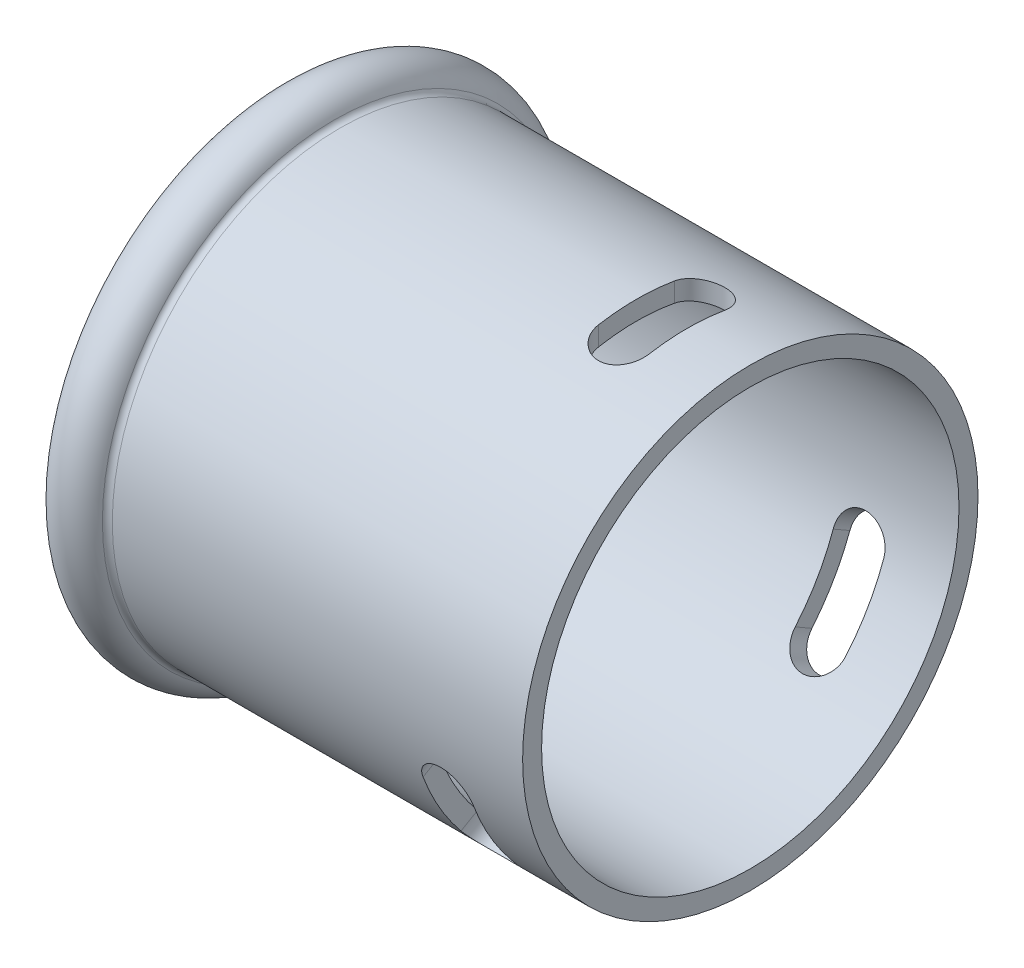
ISO-10303-21;
HEADER;
FILE_DESCRIPTION(('STEP AP214'),'2;1');
FILE_NAME('part.step','',(''),(''),'','','');
FILE_SCHEMA(('AUTOMOTIVE_DESIGN { 1 0 10303 214 1 1 1 1 }'));
ENDSEC;
DATA;
#1=APPLICATION_CONTEXT('core data for automotive mechanical design processes');
#2=APPLICATION_PROTOCOL_DEFINITION('international standard','automotive_design',2000,#1);
#3=PRODUCT_CONTEXT('',#1,'mechanical');
#4=PRODUCT('Part','Part','',(#3));
#5=PRODUCT_RELATED_PRODUCT_CATEGORY('part','',(#4));
#6=PRODUCT_DEFINITION_FORMATION('','',#4);
#7=PRODUCT_DEFINITION_CONTEXT('part definition',#1,'design');
#8=PRODUCT_DEFINITION('design','',#6,#7);
#9=PRODUCT_DEFINITION_SHAPE('','',#8);
#10=(LENGTH_UNIT() NAMED_UNIT(*) SI_UNIT(.MILLI.,.METRE.));
#11=(NAMED_UNIT(*) PLANE_ANGLE_UNIT() SI_UNIT($,.RADIAN.));
#12=(NAMED_UNIT(*) SI_UNIT($,.STERADIAN.) SOLID_ANGLE_UNIT());
#13=UNCERTAINTY_MEASURE_WITH_UNIT(LENGTH_MEASURE(1.E-05),#10,'distance_accuracy_value','');
#14=(GEOMETRIC_REPRESENTATION_CONTEXT(3) GLOBAL_UNCERTAINTY_ASSIGNED_CONTEXT((#13)) GLOBAL_UNIT_ASSIGNED_CONTEXT((#10,
#11,#12)) REPRESENTATION_CONTEXT('',''));
#15=CARTESIAN_POINT('',(0.,0.,0.));
#16=DIRECTION('',(0.,0.,1.));
#17=DIRECTION('',(1.,0.,0.));
#18=AXIS2_PLACEMENT_3D('',#15,#16,#17);
#19=CARTESIAN_POINT('',(10.6597108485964,0.,0.));
#20=DIRECTION('',(-1.,0.,0.));
#21=DIRECTION('',(0.,0.,1.));
#22=AXIS2_PLACEMENT_3D('',#19,#20,#21);
#23=CYLINDRICAL_SURFACE('',#22,16.5);
#24=CARTESIAN_POINT('',(35.6957044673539,-12.1922196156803,-11.1175438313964));
#25=CARTESIAN_POINT('',(35.8045863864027,-12.1922164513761,-11.1175487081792));
#26=CARTESIAN_POINT('',(35.913539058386,-12.1859116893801,-11.1244737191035));
#27=CARTESIAN_POINT('',(36.1283390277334,-12.1608580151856,-11.1518546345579));
#28=CARTESIAN_POINT('',(36.2341828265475,-12.1420956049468,-11.1723252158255));
#29=CARTESIAN_POINT('',(36.4395489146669,-12.0926885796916,-11.2257826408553));
#30=CARTESIAN_POINT('',(36.5390814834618,-12.0620638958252,-11.2587484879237));
#31=CARTESIAN_POINT('',(36.7294155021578,-11.9897283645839,-11.3357483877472));
#32=CARTESIAN_POINT('',(36.8202176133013,-11.9480183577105,-11.3797816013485));
#33=CARTESIAN_POINT('',(36.9930562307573,-11.8533274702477,-11.4783884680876));
#34=CARTESIAN_POINT('',(37.0748203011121,-11.8000932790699,-11.5331959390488));
#35=CARTESIAN_POINT('',(37.2250060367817,-11.6842048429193,-11.6505859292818));
#36=CARTESIAN_POINT('',(37.2934247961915,-11.6215485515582,-11.7131701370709));
#37=CARTESIAN_POINT('',(37.4177416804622,-11.4855212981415,-11.8466120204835));
#38=CARTESIAN_POINT('',(37.4730385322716,-11.4118248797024,-11.9176988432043));
#39=CARTESIAN_POINT('',(37.5660573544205,-11.2574137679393,-12.0636609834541));
#40=CARTESIAN_POINT('',(37.6037773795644,-11.176698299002,-12.1385367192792));
#41=CARTESIAN_POINT('',(37.6609530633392,-11.0090032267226,-12.2908441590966));
#42=CARTESIAN_POINT('',(37.6801368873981,-10.921949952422,-12.3682971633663));
#43=CARTESIAN_POINT('',(37.6985463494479,-10.7450000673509,-12.5223291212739));
#44=CARTESIAN_POINT('',(37.6977734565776,-10.6551036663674,-12.5989081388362));
#45=CARTESIAN_POINT('',(37.6762006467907,-10.4763294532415,-12.7479365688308));
#46=CARTESIAN_POINT('',(37.6556681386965,-10.3874540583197,-12.8204274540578));
#47=CARTESIAN_POINT('',(37.5953386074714,-10.2123126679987,-12.9603718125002));
#48=CARTESIAN_POINT('',(37.5555438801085,-10.1260463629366,-13.0278258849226));
#49=CARTESIAN_POINT('',(37.4587350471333,-9.96076546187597,-13.1546108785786));
#50=CARTESIAN_POINT('',(37.4021004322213,-9.88163655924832,-13.2140827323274));
#51=CARTESIAN_POINT('',(37.2728765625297,-9.73129892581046,-13.3251855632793));
#52=CARTESIAN_POINT('',(37.2002883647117,-9.66008967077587,-13.3768170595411));
#53=CARTESIAN_POINT('',(37.0421579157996,-9.52882684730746,-13.4706312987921));
#54=CARTESIAN_POINT('',(36.9567775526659,-9.46865225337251,-13.5129177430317));
#55=CARTESIAN_POINT('',(36.7748684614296,-9.36050232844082,-13.5880589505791));
#56=CARTESIAN_POINT('',(36.6783398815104,-9.31252683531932,-13.6209138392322));
#57=CARTESIAN_POINT('',(36.4770783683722,-9.23051503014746,-13.676624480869));
#58=CARTESIAN_POINT('',(36.3723616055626,-9.19645203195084,-13.6994993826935));
#59=CARTESIAN_POINT('',(36.1575303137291,-9.14331131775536,-13.7350241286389));
#60=CARTESIAN_POINT('',(36.0474157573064,-9.12423367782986,-13.7476739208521));
#61=CARTESIAN_POINT('',(35.824785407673,-9.10171437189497,-13.7625935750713));
#62=CARTESIAN_POINT('',(35.7122671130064,-9.09828988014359,-13.7648520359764));
#63=CARTESIAN_POINT('',(35.4881371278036,-9.10724296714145,-13.7589299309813));
#64=CARTESIAN_POINT('',(35.3765254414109,-9.1196206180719,-13.7507493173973));
#65=CARTESIAN_POINT('',(35.1573251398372,-9.15975628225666,-13.7240460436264));
#66=CARTESIAN_POINT('',(35.0497383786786,-9.18752129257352,-13.7055186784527));
#67=CARTESIAN_POINT('',(34.8417013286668,-9.25747052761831,-13.6583676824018));
#68=CARTESIAN_POINT('',(34.7412509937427,-9.29965465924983,-13.6297441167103));
#69=CARTESIAN_POINT('',(34.5504108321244,-9.3969464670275,-13.5628487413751));
#70=CARTESIAN_POINT('',(34.4600141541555,-9.45204526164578,-13.5245835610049));
#71=CARTESIAN_POINT('',(34.2917667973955,-9.57328626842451,-13.4390356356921));
#72=CARTESIAN_POINT('',(34.2139158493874,-9.63942824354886,-13.3917530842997));
#73=CARTESIAN_POINT('',(34.0730062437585,-9.78044180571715,-13.2891136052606));
#74=CARTESIAN_POINT('',(34.0099334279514,-9.8553049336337,-13.233764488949));
#75=CARTESIAN_POINT('',(33.9001897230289,-10.0113293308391,-13.1161281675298));
#76=CARTESIAN_POINT('',(33.8535187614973,-10.0924905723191,-13.0538409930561));
#77=CARTESIAN_POINT('',(33.777623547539,-10.2587992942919,-12.9235530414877));
#78=CARTESIAN_POINT('',(33.7484584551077,-10.3439592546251,-12.8555337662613));
#79=CARTESIAN_POINT('',(33.7084388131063,-10.5154220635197,-12.7156650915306));
#80=CARTESIAN_POINT('',(33.6975855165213,-10.6017249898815,-12.6438154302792));
#81=CARTESIAN_POINT('',(33.6942492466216,-10.7742159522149,-12.4971700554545));
#82=CARTESIAN_POINT('',(33.7020223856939,-10.8603858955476,-12.4223473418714));
#83=CARTESIAN_POINT('',(33.7360592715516,-11.0290912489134,-12.2728098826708));
#84=CARTESIAN_POINT('',(33.7623254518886,-11.1116261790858,-12.19809515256));
#85=CARTESIAN_POINT('',(33.8332715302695,-11.2727258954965,-12.0493951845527));
#86=CARTESIAN_POINT('',(33.8783302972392,-11.3511692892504,-11.9754590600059));
#87=CARTESIAN_POINT('',(33.985628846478,-11.5002730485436,-11.8323460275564));
#88=CARTESIAN_POINT('',(34.0478701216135,-11.5709327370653,-11.763169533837));
#89=CARTESIAN_POINT('',(34.1886783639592,-11.7035117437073,-11.6312792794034));
#90=CARTESIAN_POINT('',(34.2674085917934,-11.7653323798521,-11.5686403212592));
#91=CARTESIAN_POINT('',(34.438788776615,-11.8778496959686,-11.4530872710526));
#92=CARTESIAN_POINT('',(34.5314406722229,-11.9285448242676,-11.4001745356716));
#93=CARTESIAN_POINT('',(34.7262677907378,-12.0166218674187,-11.3072910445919));
#94=CARTESIAN_POINT('',(34.8282288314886,-12.0542382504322,-11.2670936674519));
#95=CARTESIAN_POINT('',(35.0401616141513,-12.1163823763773,-11.2002403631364));
#96=CARTESIAN_POINT('',(35.1501213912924,-12.1409292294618,-11.173564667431));
#97=CARTESIAN_POINT('',(35.3333370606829,-12.1697551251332,-11.1421414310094));
#98=CARTESIAN_POINT('',(35.40523190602,-12.1781673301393,-11.13293806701));
#99=CARTESIAN_POINT('',(35.5499754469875,-12.1894005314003,-11.120637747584));
#100=CARTESIAN_POINT('',(35.6228241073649,-12.1922217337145,-11.1175405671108));
#101=CARTESIAN_POINT('',(35.6957044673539,-12.1922196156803,-11.1175438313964));
#102=B_SPLINE_CURVE_WITH_KNOTS('',3,(#24,#25,#26,#27,#28,#29,#30,#31,#32,#33,#34,#35,#36,#37,
#38,#39,#40,#41,#42,#43,#44,#45,#46,#47,#48,#49,#50,#51,#52,#53,#54,#55,#56,#57,#58,#59,#60,#61,
#62,#63,#64,#65,#66,#67,#68,#69,#70,#71,#72,#73,#74,#75,#76,#77,#78,#79,#80,#81,#82,#83,#84,#85,
#86,#87,#88,#89,#90,#91,#92,#93,#94,#95,#96,#97,#98,#99,#100,#101),.UNSPECIFIED.,.T.,.F.,(4,2,2,
2,2,2,2,2,2,2,2,2,2,2,2,2,2,2,2,2,2,2,2,2,2,2,2,2,2,2,2,2,2,2,2,2,2,2,4),(0.,0.326372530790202,
0.653099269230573,0.979279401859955,1.30543481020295,1.63965925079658,1.97395638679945,
2.32145746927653,2.66899699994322,3.02155916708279,3.3740953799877,3.72192681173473,
4.06971679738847,4.41019703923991,4.75065473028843,5.08712003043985,5.42358085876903,
5.75939324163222,6.0952073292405,6.43138977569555,6.76757375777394,7.10391073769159,
7.4402455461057,7.77634972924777,8.11244669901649,8.4482203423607,8.7839925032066,
9.12089308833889,9.45781672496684,9.79939956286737,10.1410273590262,10.4899036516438,
10.8388102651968,11.1913502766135,11.5439394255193,11.8898350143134,12.2352234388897,
12.4536896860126,12.6721478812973),.UNSPECIFIED.);
#103=CARTESIAN_POINT('',(33.6957044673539,-10.7105665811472,-12.5512454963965));
#104=VERTEX_POINT('',#103);
#105=CARTESIAN_POINT('',(37.6957044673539,-10.7105665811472,-12.5512454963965));
#106=VERTEX_POINT('',#105);
#107=EDGE_CURVE('E220',#104,#106,#102,.T.);
#108=ORIENTED_EDGE('',*,*,#107,.F.);
#109=CARTESIAN_POINT('',(33.6957044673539,0.,0.));
#110=DIRECTION('',(1.,0.,0.));
#111=DIRECTION('',(0.,0.,-1.));
#112=AXIS2_PLACEMENT_3D('',#109,#110,#111);
#113=CIRCLE('',#112,16.5);
#114=CARTESIAN_POINT('',(33.6957044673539,-5.51441415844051,-15.5512454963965));
#115=VERTEX_POINT('',#114);
#116=EDGE_CURVE('E188',#115,#104,#113,.F.);
#117=ORIENTED_EDGE('',*,*,#116,.F.);
#118=CARTESIAN_POINT('',(37.6957044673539,-5.51441415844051,-15.5512454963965));
#119=CARTESIAN_POINT('',(37.6957038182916,-5.459241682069,-15.5708113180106));
#120=CARTESIAN_POINT('',(37.6932179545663,-5.40399233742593,-15.5900697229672));
#121=CARTESIAN_POINT('',(37.6833285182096,-5.29369573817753,-15.6278653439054));
#122=CARTESIAN_POINT('',(37.675925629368,-5.23864845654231,-15.6464026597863));
#123=CARTESIAN_POINT('',(37.6464540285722,-5.07451283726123,-15.7007177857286));
#124=CARTESIAN_POINT('',(37.6171219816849,-4.9662342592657,-15.7352683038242));
#125=CARTESIAN_POINT('',(37.540033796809,-4.75522865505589,-15.8003172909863));
#126=CARTESIAN_POINT('',(37.4922771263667,-4.65250178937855,-15.830815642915));
#127=CARTESIAN_POINT('',(37.3796454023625,-4.45553906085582,-15.8873745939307));
#128=CARTESIAN_POINT('',(37.3147700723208,-4.36130333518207,-15.9134351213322));
#129=CARTESIAN_POINT('',(37.1691207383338,-4.1837165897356,-15.9610473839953));
#130=CARTESIAN_POINT('',(37.0882533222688,-4.10043455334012,-15.9825710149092));
#131=CARTESIAN_POINT('',(36.9129498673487,-3.94826108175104,-16.020842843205));
#132=CARTESIAN_POINT('',(36.8185140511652,-3.87936941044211,-16.0375911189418));
#133=CARTESIAN_POINT('',(36.6208349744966,-3.75992389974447,-16.0660099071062));
#134=CARTESIAN_POINT('',(36.5178288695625,-3.70900271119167,-16.0777832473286));
#135=CARTESIAN_POINT('',(36.3042391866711,-3.62553631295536,-16.0968113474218));
#136=CARTESIAN_POINT('',(36.1936582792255,-3.59298466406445,-16.1040676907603));
#137=CARTESIAN_POINT('',(35.9730974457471,-3.54865571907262,-16.1138927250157));
#138=CARTESIAN_POINT('',(35.8632906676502,-3.53605645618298,-16.1166470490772));
#139=CARTESIAN_POINT('',(35.6431064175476,-3.52956915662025,-16.118069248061));
#140=CARTESIAN_POINT('',(35.5327290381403,-3.53567817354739,-16.116737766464));
#141=CARTESIAN_POINT('',(35.3174733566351,-3.56594251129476,-16.1100676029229));
#142=CARTESIAN_POINT('',(35.2125265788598,-3.58963745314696,-16.1048311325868));
#143=CARTESIAN_POINT('',(35.0080984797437,-3.6535856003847,-16.0904436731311));
#144=CARTESIAN_POINT('',(34.9086174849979,-3.69383979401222,-16.0812924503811));
#145=CARTESIAN_POINT('',(34.7162042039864,-3.79014842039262,-16.0588681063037));
#146=CARTESIAN_POINT('',(34.623396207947,-3.84643639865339,-16.045533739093));
#147=CARTESIAN_POINT('',(34.448299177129,-3.97259465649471,-16.0147649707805));
#148=CARTESIAN_POINT('',(34.3660116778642,-4.04246691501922,-15.9973299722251));
#149=CARTESIAN_POINT('',(34.2107319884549,-4.19670043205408,-15.9575777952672));
#150=CARTESIAN_POINT('',(34.1382533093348,-4.28153503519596,-15.935091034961));
#151=CARTESIAN_POINT('',(34.0084217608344,-4.46101300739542,-15.8857803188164));
#152=CARTESIAN_POINT('',(33.9510766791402,-4.55566139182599,-15.8589541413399));
#153=CARTESIAN_POINT('',(33.8513656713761,-4.75521726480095,-15.8002869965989));
#154=CARTESIAN_POINT('',(33.8095458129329,-4.86035791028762,-15.7683116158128));
#155=CARTESIAN_POINT('',(33.7448301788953,-5.07502994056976,-15.7005312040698));
#156=CARTESIAN_POINT('',(33.721905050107,-5.18455423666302,-15.6647322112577));
#157=CARTESIAN_POINT('',(33.7044370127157,-5.33119918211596,-15.6150513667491));
#158=CARTESIAN_POINT('',(33.7011628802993,-5.36786754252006,-15.6024841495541));
#159=CARTESIAN_POINT('',(33.6967993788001,-5.44117199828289,-15.5770710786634));
#160=CARTESIAN_POINT('',(33.6957065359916,-5.47780805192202,-15.5642257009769));
#161=CARTESIAN_POINT('',(33.6957044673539,-5.51441415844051,-15.5512454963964));
#162=B_SPLINE_CURVE_WITH_KNOTS('',3,(#118,#119,#120,#121,#122,#123,#124,#125,#126,#127,#128,
#129,#130,#131,#132,#133,#134,#135,#136,#137,#138,#139,#140,#141,#142,#143,#144,#145,#146,#147,
#148,#149,#150,#151,#152,#153,#154,#155,#156,#157,#158,#159,#160,#161),.UNSPECIFIED.,.F.,.F.,(4,
2,2,2,2,2,2,2,2,2,2,2,2,2,2,2,2,2,2,2,2,4),(0.,0.175504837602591,0.350985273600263,
0.701328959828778,1.05168277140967,1.40204224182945,1.75451210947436,2.10697619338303,
2.4517491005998,2.79640107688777,3.12644642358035,3.45643979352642,3.77808618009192,
4.09975176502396,4.42636588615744,4.75302762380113,5.09296168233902,5.4330703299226,
5.78420840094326,6.13479994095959,6.25145483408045,6.36792380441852),.UNSPECIFIED.);
#163=CARTESIAN_POINT('',(37.6957044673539,-5.51441415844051,-15.5512454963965));
#164=VERTEX_POINT('',#163);
#165=EDGE_CURVE('E215',#164,#115,#162,.T.);
#166=ORIENTED_EDGE('',*,*,#165,.F.);
#167=CARTESIAN_POINT('',(37.6957044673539,0.,0.));
#168=DIRECTION('',(-1.,0.,0.));
#169=DIRECTION('',(0.,0.,1.));
#170=AXIS2_PLACEMENT_3D('',#167,#168,#169);
#171=CIRCLE('',#170,16.5);
#172=EDGE_CURVE('E138',#106,#164,#171,.F.);
#173=ORIENTED_EDGE('',*,*,#172,.F.);
#174=EDGE_LOOP('',(#108,#117,#166,#173));
#175=FACE_BOUND('',#174,.T.);
#176=CARTESIAN_POINT('',(8.84134839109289,0.,0.));
#177=DIRECTION('',(-1.,0.,0.));
#178=DIRECTION('',(0.,0.,1.));
#179=AXIS2_PLACEMENT_3D('',#176,#177,#178);
#180=CIRCLE('',#179,16.5);
#181=CARTESIAN_POINT('',(8.84134839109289,0.,16.5));
#182=VERTEX_POINT('',#181);
#183=EDGE_CURVE('E294',#182,#182,#180,.T.);
#184=ORIENTED_EDGE('',*,*,#183,.T.);
#185=EDGE_LOOP('',(#184));
#186=FACE_BOUND('',#185,.T.);
#187=CARTESIAN_POINT('',(42.6957044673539,0.,0.));
#188=DIRECTION('',(-1.,0.,0.));
#189=DIRECTION('',(0.,0.,1.));
#190=AXIS2_PLACEMENT_3D('',#187,#188,#189);
#191=CIRCLE('',#190,16.5);
#192=CARTESIAN_POINT('',(42.6957044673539,0.,16.5));
#193=VERTEX_POINT('',#192);
#194=EDGE_CURVE('E286',#193,#193,#191,.T.);
#195=ORIENTED_EDGE('',*,*,#194,.F.);
#196=EDGE_LOOP('',(#195));
#197=FACE_BOUND('',#196,.T.);
#198=CARTESIAN_POINT('',(35.6957044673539,16.4696690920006,1.));
#199=CARTESIAN_POINT('',(35.807806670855,16.4696697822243,1.00000466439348));
#200=CARTESIAN_POINT('',(35.9199793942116,16.4691033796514,1.00945589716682));
#201=CARTESIAN_POINT('',(36.1412259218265,16.4667570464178,1.04702120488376));
#202=CARTESIAN_POINT('',(36.2502963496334,16.4649758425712,1.07515485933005));
#203=CARTESIAN_POINT('',(36.4621219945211,16.4599678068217,1.14927443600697));
#204=CARTESIAN_POINT('',(36.5648795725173,16.4567415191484,1.1952536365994));
#205=CARTESIAN_POINT('',(36.7611663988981,16.4485031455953,1.30372086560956));
#206=CARTESIAN_POINT('',(36.8546977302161,16.4434914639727,1.36620515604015));
#207=CARTESIAN_POINT('',(37.0298430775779,16.4312942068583,1.50580931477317));
#208=CARTESIAN_POINT('',(37.1114654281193,16.424110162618,1.58291885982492));
#209=CARTESIAN_POINT('',(37.2605758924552,16.4071978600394,1.74952971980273));
#210=CARTESIAN_POINT('',(37.3280638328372,16.3974695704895,1.83903118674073));
#211=CARTESIAN_POINT('',(37.4470424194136,16.3752011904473,2.02775704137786));
#212=CARTESIAN_POINT('',(37.4985362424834,16.3626616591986,2.12697949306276));
#213=CARTESIAN_POINT('',(37.5842154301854,16.3346672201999,2.33224512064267));
#214=CARTESIAN_POINT('',(37.6184005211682,16.3192122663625,2.4382884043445));
#215=CARTESIAN_POINT('',(37.6688543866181,16.2853865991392,2.65485730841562));
#216=CARTESIAN_POINT('',(37.6850030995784,16.266997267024,2.76540794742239));
#217=CARTESIAN_POINT('',(37.6987490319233,16.2277305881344,2.98721420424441));
#218=CARTESIAN_POINT('',(37.6963445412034,16.2068530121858,3.0984698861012));
#219=CARTESIAN_POINT('',(37.6730490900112,16.1628119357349,3.32062623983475));
#220=CARTESIAN_POINT('',(37.6518328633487,16.1396146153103,3.43148605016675));
#221=CARTESIAN_POINT('',(37.5912001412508,16.0920907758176,3.64786191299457));
#222=CARTESIAN_POINT('',(37.5517810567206,16.0677640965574,3.75337720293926));
#223=CARTESIAN_POINT('',(37.4548776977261,16.0185169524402,3.9583394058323));
#224=CARTESIAN_POINT('',(37.3970472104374,15.9935943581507,4.05762232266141));
#225=CARTESIAN_POINT('',(37.2651048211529,15.9448753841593,4.24503692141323));
#226=CARTESIAN_POINT('',(37.1909918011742,15.9210790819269,4.33316783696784));
#227=CARTESIAN_POINT('',(37.0282696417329,15.8759133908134,4.49583379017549));
#228=CARTESIAN_POINT('',(36.939643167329,15.8545469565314,4.57035234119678));
#229=CARTESIAN_POINT('',(36.7502949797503,15.815619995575,4.70329447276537));
#230=CARTESIAN_POINT('',(36.6495755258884,15.7980587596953,4.76172105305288));
#231=CARTESIAN_POINT('',(36.4421022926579,15.7684284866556,4.85892780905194));
#232=CARTESIAN_POINT('',(36.3356247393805,15.7562088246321,4.89825084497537));
#233=CARTESIAN_POINT('',(36.117095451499,15.7373902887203,4.958382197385));
#234=CARTESIAN_POINT('',(36.0050454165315,15.730789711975,4.97919612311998));
#235=CARTESIAN_POINT('',(35.7835742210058,15.7238597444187,5.00103573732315));
#236=CARTESIAN_POINT('',(35.6742380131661,15.7232805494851,5.00284968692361));
#237=CARTESIAN_POINT('',(35.4568538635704,15.7277849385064,4.988670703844));
#238=CARTESIAN_POINT('',(35.3488057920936,15.732867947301,4.97267957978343));
#239=CARTESIAN_POINT('',(35.1386466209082,15.7482200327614,4.92384001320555));
#240=CARTESIAN_POINT('',(35.0364723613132,15.7584132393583,4.89123807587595));
#241=CARTESIAN_POINT('',(34.8390938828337,15.7832729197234,4.81041303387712));
#242=CARTESIAN_POINT('',(34.7438904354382,15.7979398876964,4.76218820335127));
#243=CARTESIAN_POINT('',(34.5604667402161,15.8312779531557,4.6501749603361));
#244=CARTESIAN_POINT('',(34.4724878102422,15.8500419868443,4.58601955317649));
#245=CARTESIAN_POINT('',(34.308403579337,15.8902524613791,4.44468962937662));
#246=CARTESIAN_POINT('',(34.2323008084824,15.9116994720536,4.36751234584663));
#247=CARTESIAN_POINT('',(34.0908081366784,15.9570885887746,4.1987213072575));
#248=CARTESIAN_POINT('',(34.025997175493,15.9810974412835,4.10663981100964));
#249=CARTESIAN_POINT('',(33.9127361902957,16.029604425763,3.91302140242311));
#250=CARTESIAN_POINT('',(33.8642886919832,16.054102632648,3.81148303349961));
#251=CARTESIAN_POINT('',(33.7840745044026,16.1030729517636,3.59905436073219));
#252=CARTESIAN_POINT('',(33.7527386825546,16.1275301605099,3.48799748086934));
#253=CARTESIAN_POINT('',(33.7095749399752,16.1747934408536,3.26180917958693));
#254=CARTESIAN_POINT('',(33.6977466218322,16.1975995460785,3.14667784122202));
#255=CARTESIAN_POINT('',(33.6941587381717,16.2406459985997,2.91634339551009));
#256=CARTESIAN_POINT('',(33.7022768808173,16.2609011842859,2.80114503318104));
#257=CARTESIAN_POINT('',(33.7383334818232,16.2984943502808,2.57340261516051));
#258=CARTESIAN_POINT('',(33.7662695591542,16.3158326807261,2.46085824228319));
#259=CARTESIAN_POINT('',(33.8405455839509,16.347026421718,2.24420711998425));
#260=CARTESIAN_POINT('',(33.8864851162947,16.3609475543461,2.1399725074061));
#261=CARTESIAN_POINT('',(33.9955669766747,16.3857985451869,1.94054460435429));
#262=CARTESIAN_POINT('',(34.0587072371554,16.3967287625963,1.84535022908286));
#263=CARTESIAN_POINT('',(34.1993123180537,16.4156801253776,1.66831229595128));
#264=CARTESIAN_POINT('',(34.2765393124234,16.4237438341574,1.5862842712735));
#265=CARTESIAN_POINT('',(34.4437924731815,16.4375454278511,1.43624249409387));
#266=CARTESIAN_POINT('',(34.5338210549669,16.4432828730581,1.36823139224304));
#267=CARTESIAN_POINT('',(34.7237072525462,16.4528073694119,1.24849303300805));
#268=CARTESIAN_POINT('',(34.8235249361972,16.4566019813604,1.19670295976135));
#269=CARTESIAN_POINT('',(35.0303882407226,16.462638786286,1.11058708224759));
#270=CARTESIAN_POINT('',(35.1374262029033,16.4648825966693,1.07624309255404));
#271=CARTESIAN_POINT('',(35.3201143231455,16.4675696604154,1.03412905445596));
#272=CARTESIAN_POINT('',(35.3946438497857,16.4683612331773,1.02134831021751));
#273=CARTESIAN_POINT('',(35.5446730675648,16.469410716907,1.004282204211));
#274=CARTESIAN_POINT('',(35.620172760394,16.4696686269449,0.99999685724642));
#275=CARTESIAN_POINT('',(35.6957044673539,16.4696690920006,1.));
#276=B_SPLINE_CURVE_WITH_KNOTS('',3,(#198,#199,#200,#201,#202,#203,#204,#205,#206,#207,#208,
#209,#210,#211,#212,#213,#214,#215,#216,#217,#218,#219,#220,#221,#222,#223,#224,#225,#226,#227,
#228,#229,#230,#231,#232,#233,#234,#235,#236,#237,#238,#239,#240,#241,#242,#243,#244,#245,#246,
#247,#248,#249,#250,#251,#252,#253,#254,#255,#256,#257,#258,#259,#260,#261,#262,#263,#264,#265,
#266,#267,#268,#269,#270,#271,#272,#273,#274,#275),.UNSPECIFIED.,.T.,.F.,(4,2,2,2,2,2,2,2,2,2,2,
2,2,2,2,2,2,2,2,2,2,2,2,2,2,2,2,2,2,2,2,2,2,2,2,2,2,2,4),(0.,0.336032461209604,
0.672417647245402,1.00867625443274,1.34485877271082,1.68080487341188,2.01675509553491,
2.35263854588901,2.68852730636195,3.02663887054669,3.36478159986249,3.7088875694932,
4.05304249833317,4.40409465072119,4.75517091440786,5.10666960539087,5.45810272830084,
5.79886090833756,6.1395157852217,6.46597884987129,6.79240875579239,7.11412970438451,
7.43588620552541,7.76588388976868,8.09595178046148,8.43978115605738,8.78366357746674,
9.13584660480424,9.48802245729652,9.83804451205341,10.1880245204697,10.5306260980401,
10.8731865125,11.2104240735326,11.5477253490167,11.8837037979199,12.219331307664,
12.445741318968,12.6721517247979),.UNSPECIFIED.);
#277=CARTESIAN_POINT('',(37.6957044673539,16.224980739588,3.));
#278=VERTEX_POINT('',#277);
#279=CARTESIAN_POINT('',(33.6957044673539,16.224980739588,3.));
#280=VERTEX_POINT('',#279);
#281=EDGE_CURVE('E208',#278,#280,#276,.T.);
#282=ORIENTED_EDGE('',*,*,#281,.F.);
#283=CARTESIAN_POINT('',(37.6957044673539,0.,0.));
#284=DIRECTION('',(-1.,0.,0.));
#285=DIRECTION('',(0.,0.,1.));
#286=AXIS2_PLACEMENT_3D('',#283,#284,#285);
#287=CIRCLE('',#286,16.5);
#288=CARTESIAN_POINT('',(37.6957044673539,16.224980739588,-3.));
#289=VERTEX_POINT('',#288);
#290=EDGE_CURVE('E332',#289,#278,#287,.F.);
#291=ORIENTED_EDGE('',*,*,#290,.F.);
#292=CARTESIAN_POINT('',(35.6957044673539,15.7241851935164,-5.00000000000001));
#293=CARTESIAN_POINT('',(35.8045863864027,15.7241878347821,-4.99999482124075));
#294=CARTESIAN_POINT('',(35.913539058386,15.727032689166,-4.99107223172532));
#295=CARTESIAN_POINT('',(36.1283390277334,15.7382184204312,-4.95568465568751));
#296=CARTESIAN_POINT('',(36.2341828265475,15.7465652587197,-4.92920064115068));
#297=CARTESIAN_POINT('',(36.4395489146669,15.7681572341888,-4.85968418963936));
#298=CARTESIAN_POINT('',(36.5390814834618,15.7813941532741,-4.81667951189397));
#299=CARTESIAN_POINT('',(36.7294155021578,15.8119102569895,-4.71553515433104));
#300=CARTESIAN_POINT('',(36.8202176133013,15.8291891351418,-4.65739662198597));
#301=CARTESIAN_POINT('',(36.9930562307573,15.867239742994,-4.52608847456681));
#302=CARTESIAN_POINT('',(37.0748203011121,15.8880873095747,-4.45258257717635));
#303=CARTESIAN_POINT('',(37.2250060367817,15.9318058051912,-4.29352525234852));
#304=CARTESIAN_POINT('',(37.2934247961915,15.9546771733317,-4.20797120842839));
#305=CARTESIAN_POINT('',(37.4177416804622,16.0022276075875,-4.02344720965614));
#306=CARTESIAN_POINT('',(37.4730385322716,16.0269423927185,-3.92408082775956));
#307=CARTESIAN_POINT('',(37.5660573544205,16.076143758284,-3.71737581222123));
#308=CARTESIAN_POINT('',(37.6037773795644,16.100630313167,-3.61003629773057));
#309=CARTESIAN_POINT('',(37.6609530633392,16.1486848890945,-3.38865438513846));
#310=CARTESIAN_POINT('',(37.6801368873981,16.1722345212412,-3.27453753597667));
#311=CARTESIAN_POINT('',(37.6985463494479,16.2171551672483,-3.04427846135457));
#312=CARTESIAN_POINT('',(37.6977734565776,16.2385263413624,-2.92813638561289));
#313=CARTESIAN_POINT('',(37.6762006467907,16.2782016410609,-2.69879916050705));
#314=CARTESIAN_POINT('',(37.6556681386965,16.2965428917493,-2.58558536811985));
#315=CARTESIAN_POINT('',(37.5953386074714,16.3301675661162,-2.36393629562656));
#316=CARTESIAN_POINT('',(37.5555438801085,16.3454513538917,-2.25550044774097));
#317=CARTESIAN_POINT('',(37.4587350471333,16.3726099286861,-2.04897049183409));
#318=CARTESIAN_POINT('',(37.4021004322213,16.384549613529,-1.95070692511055));
#319=CARTESIAN_POINT('',(37.2728765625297,16.4055986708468,-1.76495929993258));
#320=CARTESIAN_POINT('',(37.2002883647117,16.4147082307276,-1.67747452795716));
#321=CARTESIAN_POINT('',(37.0421579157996,16.4303223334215,-1.51689046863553));
#322=CARTESIAN_POINT('',(36.9567775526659,16.4368561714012,-1.44363451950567));
#323=CARTESIAN_POINT('',(36.7748684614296,16.4478554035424,-1.31240333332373));
#324=CARTESIAN_POINT('',(36.6783398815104,16.4523208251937,-1.25442789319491));
#325=CARTESIAN_POINT('',(36.4770783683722,16.4595617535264,-1.15554826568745));
#326=CARTESIAN_POINT('',(36.3723616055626,16.4623405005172,-1.11461139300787));
#327=CARTESIAN_POINT('',(36.1575303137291,16.4665354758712,-1.05082781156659));
#328=CARTESIAN_POINT('',(36.0474157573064,16.4679516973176,-1.02798119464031));
#329=CARTESIAN_POINT('',(35.824785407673,16.4696128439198,-1.00101907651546));
#330=CARTESIAN_POINT('',(35.7122671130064,16.4698564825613,-0.99692414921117));
#331=CARTESIAN_POINT('',(35.4881371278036,16.4692043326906,-1.00763880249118));
#332=CARTESIAN_POINT('',(35.3765254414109,16.4683085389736,-1.0224484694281));
#333=CARTESIAN_POINT('',(35.1573251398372,16.4652506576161,-1.07055861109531));
#334=CARTESIAN_POINT('',(35.0497383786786,16.4630879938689,-1.1038674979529));
#335=CARTESIAN_POINT('',(34.8417013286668,16.4572286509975,-1.18802081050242));
#336=CARTESIAN_POINT('',(34.7412509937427,16.4535319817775,-1.23886512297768));
#337=CARTESIAN_POINT('',(34.5504108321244,16.4442447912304,-1.35656998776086));
#338=CARTESIAN_POINT('',(34.4600141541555,16.4386555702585,-1.4234195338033));
#339=CARTESIAN_POINT('',(34.2917667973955,16.425189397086,-1.57119128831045));
#340=CARTESIAN_POINT('',(34.2139158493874,16.4173124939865,-1.65211319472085));
#341=CARTESIAN_POINT('',(34.0730062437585,16.3989308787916,-1.82555426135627));
#342=CARTESIAN_POINT('',(34.0099334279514,16.388428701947,-1.91806219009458));
#343=CARTESIAN_POINT('',(33.9001897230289,16.3645648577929,-2.11200144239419));
#344=CARTESIAN_POINT('',(33.8535187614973,16.3512032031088,-2.21343272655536));
#345=CARTESIAN_POINT('',(33.777623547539,16.32152488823,-2.42260428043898));
#346=CARTESIAN_POINT('',(33.7484584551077,16.3051984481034,-2.53036460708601));
#347=CARTESIAN_POINT('',(33.7084388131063,16.2698000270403,-2.74879009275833));
#348=CARTESIAN_POINT('',(33.6975855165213,16.2507278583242,-2.85945545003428));
#349=CARTESIAN_POINT('',(33.6942492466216,16.2099747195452,-3.0821596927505));
#350=CARTESIAN_POINT('',(33.7020223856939,16.1882613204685,-3.19419640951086));
#351=CARTESIAN_POINT('',(33.7360592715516,16.1431107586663,-3.41506826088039));
#352=CARTESIAN_POINT('',(33.7623254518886,16.1196733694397,-3.52390297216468));
#353=CARTESIAN_POINT('',(33.8332715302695,16.0714452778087,-3.73776940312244));
#354=CARTESIAN_POINT('',(33.8783302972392,16.0466364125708,-3.84267143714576));
#355=CARTESIAN_POINT('',(33.985628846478,15.9972487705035,-4.04335559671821));
#356=CARTESIAN_POINT('',(34.0478701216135,15.9726700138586,-4.13913692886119));
#357=CARTESIAN_POINT('',(34.1886783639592,15.9247392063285,-4.31989884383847));
#358=CARTESIAN_POINT('',(34.2674085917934,15.9014025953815,-4.40475656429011));
#359=CARTESIAN_POINT('',(34.438788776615,15.857589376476,-4.55997594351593));
#360=CARTESIAN_POINT('',(34.5314406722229,15.8371131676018,-4.63033558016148));
#361=CARTESIAN_POINT('',(34.7262677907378,15.8007122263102,-4.75305428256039));
#362=CARTESIAN_POINT('',(34.8282288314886,15.7847084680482,-4.80572971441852));
#363=CARTESIAN_POINT('',(35.0401616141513,15.7578838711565,-4.89297475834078));
#364=CARTESIAN_POINT('',(35.1501213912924,15.7470554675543,-4.92757080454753));
#365=CARTESIAN_POINT('',(35.3333370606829,15.7342550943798,-4.96824638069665));
#366=CARTESIAN_POINT('',(35.40523190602,15.7304908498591,-4.98013324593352));
#367=CARTESIAN_POINT('',(35.5499754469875,15.725455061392,-4.99601164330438));
#368=CARTESIAN_POINT('',(35.6228241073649,15.7241834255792,-5.00000346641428));
#369=CARTESIAN_POINT('',(35.6957044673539,15.7241851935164,-5.00000000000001));
#370=B_SPLINE_CURVE_WITH_KNOTS('',3,(#292,#293,#294,#295,#296,#297,#298,#299,#300,#301,#302,
#303,#304,#305,#306,#307,#308,#309,#310,#311,#312,#313,#314,#315,#316,#317,#318,#319,#320,#321,
#322,#323,#324,#325,#326,#327,#328,#329,#330,#331,#332,#333,#334,#335,#336,#337,#338,#339,#340,
#341,#342,#343,#344,#345,#346,#347,#348,#349,#350,#351,#352,#353,#354,#355,#356,#357,#358,#359,
#360,#361,#362,#363,#364,#365,#366,#367,#368,#369),.UNSPECIFIED.,.T.,.F.,(4,2,2,2,2,2,2,2,2,2,2,
2,2,2,2,2,2,2,2,2,2,2,2,2,2,2,2,2,2,2,2,2,2,2,2,2,2,2,4),(0.,0.326372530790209,
0.653099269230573,0.979279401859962,1.30543481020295,1.63965925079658,1.97395638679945,
2.32145746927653,2.66899699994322,3.02155916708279,3.37409537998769,3.72192681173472,
4.06971679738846,4.41019703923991,4.75065473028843,5.08712003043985,5.42358085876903,
5.75939324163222,6.09520732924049,6.43138977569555,6.76757375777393,7.10391073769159,
7.4402455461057,7.77634972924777,8.11244669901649,8.44822034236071,8.7839925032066,
9.12089308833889,9.45781672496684,9.79939956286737,10.1410273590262,10.4899036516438,
10.8388102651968,11.1913502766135,11.5439394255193,11.8898350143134,12.2352234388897,
12.4536896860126,12.6721478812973),.UNSPECIFIED.);
#371=CARTESIAN_POINT('',(33.6957044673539,16.224980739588,-3.));
#372=VERTEX_POINT('',#371);
#373=EDGE_CURVE('E199',#372,#289,#370,.T.);
#374=ORIENTED_EDGE('',*,*,#373,.F.);
#375=CARTESIAN_POINT('',(33.6957044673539,0.,0.));
#376=DIRECTION('',(1.,0.,0.));
#377=DIRECTION('',(0.,0.,-1.));
#378=AXIS2_PLACEMENT_3D('',#375,#376,#377);
#379=CIRCLE('',#378,16.5);
#380=EDGE_CURVE('E330',#280,#372,#379,.F.);
#381=ORIENTED_EDGE('',*,*,#380,.F.);
#382=EDGE_LOOP('',(#282,#291,#374,#381));
#383=FACE_BOUND('',#382,.T.);
#384=CARTESIAN_POINT('',(35.6957044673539,-9.10085994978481,13.7631518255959));
#385=CARTESIAN_POINT('',(35.807806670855,-9.1008643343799,13.7631500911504));
#386=CARTESIAN_POINT('',(35.9199793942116,-9.10876614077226,13.7579339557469));
#387=CARTESIAN_POINT('',(36.1412259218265,-9.1401254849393,13.7371193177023));
#388=CARTESIAN_POINT('',(36.2502963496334,-9.16359934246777,13.7215099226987));
#389=CARTESIAN_POINT('',(36.4621219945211,-9.22528476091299,13.6801130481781));
#390=CARTESIAN_POINT('',(36.5648795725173,-9.26349077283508,13.6543294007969));
#391=CARTESIAN_POINT('',(36.7611663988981,-9.3533069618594,13.5929611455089));
#392=CARTESIAN_POINT('',(36.8546977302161,-9.40491410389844,13.5573787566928));
#393=CARTESIAN_POINT('',(37.0298430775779,-9.51971622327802,13.4770135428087));
#394=CARTESIAN_POINT('',(37.1114654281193,-9.58290302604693,13.4322372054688));
#395=CARTESIAN_POINT('',(37.2605758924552,-9.71873611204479,13.3342852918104));
#396=CARTESIAN_POINT('',(37.3280638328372,-9.79138251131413,13.2811096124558));
#397=CARTESIAN_POINT('',(37.4470424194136,-9.94368970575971,13.1674617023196));
#398=CARTESIAN_POINT('',(37.4985362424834,-10.0233491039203,13.1069909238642));
#399=CARTESIAN_POINT('',(37.5842154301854,-10.1871171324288,12.9801142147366));
#400=CARTESIAN_POINT('',(37.6184005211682,-10.2712258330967,12.9137081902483));
#401=CARTESIAN_POINT('',(37.6688543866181,-10.4418671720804,12.7761298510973));
#402=CARTESIAN_POINT('',(37.6850030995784,-10.5284121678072,12.7049289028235));
#403=CARTESIAN_POINT('',(37.6987490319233,-10.7008686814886,12.5600198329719));
#404=CARTESIAN_POINT('',(37.6963445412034,-10.7867801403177,12.4863114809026));
#405=CARTESIAN_POINT('',(37.6730490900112,-10.9571526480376,12.3370926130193));
#406=CARTESIAN_POINT('',(37.6518328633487,-11.0415613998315,12.2615732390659));
#407=CARTESIAN_POINT('',(37.5912001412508,-11.2051864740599,12.112228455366));
#408=CARTESIAN_POINT('',(37.5517810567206,-11.2844020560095,12.0384032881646));
#409=CARTESIAN_POINT('',(37.4548776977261,-11.4372809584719,11.8932729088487));
#410=CARTESIAN_POINT('',(37.3970472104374,-11.510801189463,11.8220478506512));
#411=CARTESIAN_POINT('',(37.2651048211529,-11.6487475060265,11.6861486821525));
#412=CARTESIAN_POINT('',(37.1909918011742,-11.7131729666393,11.6214750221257));
#413=CARTESIAN_POINT('',(37.0282696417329,-11.8314629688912,11.5010274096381));
#414=CARTESIAN_POINT('',(36.939643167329,-11.8853147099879,11.445264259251));
#415=CARTESIAN_POINT('',(36.7502949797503,-11.9809824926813,11.3450814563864));
#416=CARTESIAN_POINT('',(36.6495755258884,-12.0228007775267,11.3006596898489));
#417=CARTESIAN_POINT('',(36.4421022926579,-12.0921691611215,11.2263957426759));
#418=CARTESIAN_POINT('',(36.3356247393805,-12.1201140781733,11.1961516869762));
#419=CARTESIAN_POINT('',(36.117095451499,-12.1627800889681,11.1497886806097));
#420=CARTESIAN_POINT('',(36.0050454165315,-12.1775051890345,11.1336654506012));
#421=CARTESIAN_POINT('',(35.7835742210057,-12.1929538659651,11.1167441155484));
#422=CARTESIAN_POINT('',(35.6742380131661,-12.1942351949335,11.115335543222));
#423=CARTESIAN_POINT('',(35.4568538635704,-12.1842080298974,11.1263259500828));
#424=CARTESIAN_POINT('',(35.3488057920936,-12.1729008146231,11.1387235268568));
#425=CARTESIAN_POINT('',(35.1386466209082,-12.1382805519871,11.1764386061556));
#426=CARTESIAN_POINT('',(35.0364723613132,-12.1151430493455,11.2015671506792));
#427=CARTESIAN_POINT('',(34.8390938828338,-12.0575763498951,11.2635087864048));
#428=CARTESIAN_POINT('',(34.7438904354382,-12.023145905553,11.3003231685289));
#429=CARTESIAN_POINT('',(34.5604667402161,-11.9428086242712,11.3852014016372));
#430=CARTESIAN_POINT('',(34.4724878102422,-11.8966304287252,11.4335292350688));
#431=CARTESIAN_POINT('',(34.308403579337,-11.794340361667,11.5390174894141));
#432=CARTESIAN_POINT('',(34.2323008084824,-11.7382263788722,11.5961797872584));
#433=CARTESIAN_POINT('',(34.0908081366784,-11.6147436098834,11.7198834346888));
#434=CARTESIAN_POINT('',(34.025997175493,-11.5470031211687,11.7867164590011));
#435=CARTESIAN_POINT('',(33.9127361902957,-11.4035781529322,11.9255339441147));
#436=CARTESIAN_POINT('',(33.8642886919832,-11.3278924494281,11.9975191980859));
#437=CARTESIAN_POINT('',(33.7840745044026,-11.1684089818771,12.1461430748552));
#438=CARTESIAN_POINT('',(33.7527386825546,-11.084459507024,12.2228520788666));
#439=CARTESIAN_POINT('',(33.7095749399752,-10.9122063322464,12.3768774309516));
#440=CARTESIAN_POINT('',(33.6977466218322,-10.8239027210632,12.4541937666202));
#441=CARTESIAN_POINT('',(33.6941587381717,-10.6459504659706,12.6066403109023));
#442=CARTESIAN_POINT('',(33.7022768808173,-10.5563133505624,12.6817809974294));
#443=CARTESIAN_POINT('',(33.7383334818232,-10.3778792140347,12.8282088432));
#444=CARTESIAN_POINT('',(33.7662695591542,-10.2890820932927,12.8994964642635));
#445=CARTESIAN_POINT('',(33.8405455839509,-10.1170535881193,13.0348365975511));
#446=CARTESIAN_POINT('',(33.8864851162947,-10.0337443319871,13.0990099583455));
#447=CARTESIAN_POINT('',(33.9955669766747,-9.87346019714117,13.2202454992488));
#448=CARTESIAN_POINT('',(34.0587072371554,-9.79648455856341,13.2773085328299));
#449=CARTESIAN_POINT('',(34.1993123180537,-9.65264089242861,13.3822398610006));
#450=CARTESIAN_POINT('',(34.2765393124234,-9.58563439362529,13.4302372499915));
#451=CARTESIAN_POINT('',(34.4437924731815,-9.46259519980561,13.5172106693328));
#452=CARTESIAN_POINT('',(34.533821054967,-9.40656458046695,13.5561849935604));
#453=CARTESIAN_POINT('',(34.7237072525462,-9.30763036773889,13.6243026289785));
#454=CARTESIAN_POINT('',(34.8235249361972,-9.26467615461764,13.6534838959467));
#455=CARTESIAN_POINT('',(35.0303882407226,-9.19311601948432,13.7017698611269));
#456=CARTESIAN_POINT('',(35.1374262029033,-9.16449515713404,13.7208850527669));
#457=CARTESIAN_POINT('',(35.3201143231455,-9.12936686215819,13.7442691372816));
#458=CARTESIAN_POINT('',(35.3946438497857,-9.11869419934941,13.7513450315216));
#459=CARTESIAN_POINT('',(35.5446730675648,-9.10443925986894,13.7607869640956));
#460=CARTESIAN_POINT('',(35.620172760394,-9.10085699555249,13.7631529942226));
#461=CARTESIAN_POINT('',(35.6957044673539,-9.10085994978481,13.7631518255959));
#462=B_SPLINE_CURVE_WITH_KNOTS('',3,(#384,#385,#386,#387,#388,#389,#390,#391,#392,#393,#394,
#395,#396,#397,#398,#399,#400,#401,#402,#403,#404,#405,#406,#407,#408,#409,#410,#411,#412,#413,
#414,#415,#416,#417,#418,#419,#420,#421,#422,#423,#424,#425,#426,#427,#428,#429,#430,#431,#432,
#433,#434,#435,#436,#437,#438,#439,#440,#441,#442,#443,#444,#445,#446,#447,#448,#449,#450,#451,
#452,#453,#454,#455,#456,#457,#458,#459,#460,#461),.UNSPECIFIED.,.T.,.F.,(4,2,2,2,2,2,2,2,2,2,2,
2,2,2,2,2,2,2,2,2,2,2,2,2,2,2,2,2,2,2,2,2,2,2,2,2,2,2,4),(0.,0.336032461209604,
0.672417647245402,1.00867625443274,1.34485877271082,1.68080487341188,2.01675509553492,
2.35263854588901,2.68852730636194,3.02663887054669,3.3647815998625,3.70888756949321,
4.05304249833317,4.4040946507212,4.75517091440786,5.10666960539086,5.45810272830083,
5.79886090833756,6.13951578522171,6.46597884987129,6.7924087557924,7.1141297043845,
7.4358862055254,7.76588388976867,8.09595178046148,8.43978115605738,8.78366357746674,
9.13584660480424,9.48802245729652,9.83804451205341,10.1880245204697,10.5306260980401,
10.8731865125,11.2104240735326,11.5477253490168,11.8837037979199,12.219331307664,
12.445741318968,12.6721517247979),.UNSPECIFIED.);
#463=CARTESIAN_POINT('',(37.6957044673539,-10.7105665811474,12.5512454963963));
#464=VERTEX_POINT('',#463);
#465=CARTESIAN_POINT('',(33.6957044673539,-10.7105665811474,12.5512454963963));
#466=VERTEX_POINT('',#465);
#467=EDGE_CURVE('E315',#464,#466,#462,.T.);
#468=ORIENTED_EDGE('',*,*,#467,.F.);
#469=CARTESIAN_POINT('',(37.6957044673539,-5.51441415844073,15.5512454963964));
#470=VERTEX_POINT('',#469);
#471=EDGE_CURVE('E320',#470,#464,#171,.F.);
#472=ORIENTED_EDGE('',*,*,#471,.F.);
#473=CARTESIAN_POINT('',(33.6957044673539,-5.51441415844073,15.5512454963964));
#474=CARTESIAN_POINT('',(33.6957051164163,-5.45924168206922,15.5708113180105));
#475=CARTESIAN_POINT('',(33.6981909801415,-5.40399233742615,15.5900697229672));
#476=CARTESIAN_POINT('',(33.7080804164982,-5.29369573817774,15.6278653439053));
#477=CARTESIAN_POINT('',(33.7154833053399,-5.23864845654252,15.6464026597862));
#478=CARTESIAN_POINT('',(33.7449549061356,-5.07451283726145,15.7007177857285));
#479=CARTESIAN_POINT('',(33.774286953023,-4.96623425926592,15.7352683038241));
#480=CARTESIAN_POINT('',(33.8513751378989,-4.75522865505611,15.8003172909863));
#481=CARTESIAN_POINT('',(33.8991318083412,-4.65250178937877,15.8308156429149));
#482=CARTESIAN_POINT('',(34.0117635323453,-4.45553906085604,15.8873745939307));
#483=CARTESIAN_POINT('',(34.0766388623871,-4.36130333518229,15.9134351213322));
#484=CARTESIAN_POINT('',(34.2222881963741,-4.18371658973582,15.9610473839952));
#485=CARTESIAN_POINT('',(34.3031556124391,-4.10043455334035,15.9825710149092));
#486=CARTESIAN_POINT('',(34.4784590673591,-3.94826108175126,16.0208428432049));
#487=CARTESIAN_POINT('',(34.5728948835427,-3.87936941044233,16.0375911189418));
#488=CARTESIAN_POINT('',(34.7705739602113,-3.75992389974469,16.0660099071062));
#489=CARTESIAN_POINT('',(34.8735800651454,-3.70900271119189,16.0777832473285));
#490=CARTESIAN_POINT('',(35.0871697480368,-3.62553631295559,16.0968113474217));
#491=CARTESIAN_POINT('',(35.1977506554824,-3.59298466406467,16.1040676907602));
#492=CARTESIAN_POINT('',(35.4183114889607,-3.54865571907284,16.1138927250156));
#493=CARTESIAN_POINT('',(35.5281182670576,-3.53605645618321,16.1166470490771));
#494=CARTESIAN_POINT('',(35.7483025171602,-3.52956915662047,16.118069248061));
#495=CARTESIAN_POINT('',(35.8586798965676,-3.53567817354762,16.1167377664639));
#496=CARTESIAN_POINT('',(36.0739355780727,-3.56594251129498,16.1100676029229));
#497=CARTESIAN_POINT('',(36.1788823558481,-3.58963745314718,16.1048311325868));
#498=CARTESIAN_POINT('',(36.3833104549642,-3.65358560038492,16.0904436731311));
#499=CARTESIAN_POINT('',(36.48279144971,-3.69383979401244,16.0812924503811));
#500=CARTESIAN_POINT('',(36.6752047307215,-3.79014842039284,16.0588681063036));
#501=CARTESIAN_POINT('',(36.7680127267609,-3.84643639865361,16.045533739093));
#502=CARTESIAN_POINT('',(36.9431097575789,-3.97259465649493,16.0147649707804));
#503=CARTESIAN_POINT('',(37.0253972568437,-4.04246691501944,15.997329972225));
#504=CARTESIAN_POINT('',(37.180676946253,-4.1967004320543,15.9575777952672));
#505=CARTESIAN_POINT('',(37.253155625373,-4.28153503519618,15.935091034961));
#506=CARTESIAN_POINT('',(37.3829871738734,-4.46101300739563,15.8857803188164));
#507=CARTESIAN_POINT('',(37.4403322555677,-4.55566139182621,15.8589541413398));
#508=CARTESIAN_POINT('',(37.5400432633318,-4.75521726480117,15.8002869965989));
#509=CARTESIAN_POINT('',(37.5818631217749,-4.86035791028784,15.7683116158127));
#510=CARTESIAN_POINT('',(37.6465787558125,-5.07502994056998,15.7005312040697));
#511=CARTESIAN_POINT('',(37.6695038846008,-5.18455423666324,15.6647322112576));
#512=CARTESIAN_POINT('',(37.6869719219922,-5.33119918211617,15.615051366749));
#513=CARTESIAN_POINT('',(37.6902460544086,-5.36786754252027,15.602484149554));
#514=CARTESIAN_POINT('',(37.6946095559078,-5.4411719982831,15.5770710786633));
#515=CARTESIAN_POINT('',(37.6957023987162,-5.47780805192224,15.5642257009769));
#516=CARTESIAN_POINT('',(37.6957044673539,-5.51441415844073,15.5512454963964));
#517=B_SPLINE_CURVE_WITH_KNOTS('',3,(#473,#474,#475,#476,#477,#478,#479,#480,#481,#482,#483,
#484,#485,#486,#487,#488,#489,#490,#491,#492,#493,#494,#495,#496,#497,#498,#499,#500,#501,#502,
#503,#504,#505,#506,#507,#508,#509,#510,#511,#512,#513,#514,#515,#516),.UNSPECIFIED.,.F.,.F.,(4,
2,2,2,2,2,2,2,2,2,2,2,2,2,2,2,2,2,2,2,2,4),(0.,0.17550483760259,0.350985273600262,
0.701328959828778,1.05168277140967,1.40204224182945,1.75451210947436,2.10697619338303,
2.45174910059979,2.79640107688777,3.12644642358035,3.45643979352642,3.77808618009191,
4.09975176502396,4.42636588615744,4.75302762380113,5.09296168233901,5.43307032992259,
5.78420840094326,6.1347999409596,6.25145483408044,6.36792380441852),.UNSPECIFIED.);
#518=CARTESIAN_POINT('',(33.6957044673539,-5.51441415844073,15.5512454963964));
#519=VERTEX_POINT('',#518);
#520=EDGE_CURVE('E182',#519,#470,#517,.T.);
#521=ORIENTED_EDGE('',*,*,#520,.F.);
#522=EDGE_CURVE('E189',#466,#519,#113,.F.);
#523=ORIENTED_EDGE('',*,*,#522,.F.);
#524=EDGE_LOOP('',(#468,#472,#521,#523));
#525=FACE_BOUND('',#524,.T.);
#526=ADVANCED_FACE('F31',(#175,#186,#197,#383,#525),#23,.F.);
#527=CARTESIAN_POINT('',(10.6597108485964,0.,0.));
#528=DIRECTION('',(-1.,0.,0.));
#529=DIRECTION('',(0.,0.,1.));
#530=AXIS2_PLACEMENT_3D('',#527,#528,#529);
#531=CYLINDRICAL_SURFACE('',#530,18.);
#532=CARTESIAN_POINT('',(35.6957044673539,-12.9759352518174,-12.4749791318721));
#533=CARTESIAN_POINT('',(35.5862628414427,-12.9759319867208,-12.4749838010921));
#534=CARTESIAN_POINT('',(35.4767487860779,-12.9694326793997,-12.4817537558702));
#535=CARTESIAN_POINT('',(35.2608241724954,-12.9436017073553,-12.5085373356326));
#536=CARTESIAN_POINT('',(35.1544171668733,-12.9242559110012,-12.5285655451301));
#537=CARTESIAN_POINT('',(34.9479270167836,-12.8732991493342,-12.5809177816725));
#538=CARTESIAN_POINT('',(34.8478347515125,-12.8417063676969,-12.6132235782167));
#539=CARTESIAN_POINT('',(34.6564614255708,-12.7670787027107,-12.6887551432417));
#540=CARTESIAN_POINT('',(34.5651794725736,-12.7240449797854,-12.7319798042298));
#541=CARTESIAN_POINT('',(34.3918615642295,-12.6265535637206,-12.8286765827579));
#542=CARTESIAN_POINT('',(34.3100576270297,-12.5718767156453,-12.8823432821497));
#543=CARTESIAN_POINT('',(34.1599294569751,-12.4529318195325,-12.9973583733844));
#544=CARTESIAN_POINT('',(34.0916078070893,-12.3886619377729,-13.0587082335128));
#545=CARTESIAN_POINT('',(33.9680850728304,-12.2497106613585,-13.189160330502));
#546=CARTESIAN_POINT('',(33.9133898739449,-12.1747562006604,-13.2584512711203));
#547=CARTESIAN_POINT('',(33.8215827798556,-12.0179314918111,-13.4007659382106));
#548=CARTESIAN_POINT('',(33.7844724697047,-11.9360606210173,-13.4737900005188));
#549=CARTESIAN_POINT('',(33.7285851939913,-11.7664336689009,-13.6221832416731));
#550=CARTESIAN_POINT('',(33.7100313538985,-11.6786192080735,-13.6975699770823));
#551=CARTESIAN_POINT('',(33.6927228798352,-11.5003919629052,-13.8475464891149));
#552=CARTESIAN_POINT('',(33.6939670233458,-11.4099793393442,-13.9221363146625));
#553=CARTESIAN_POINT('',(33.7162869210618,-11.2302373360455,-14.0675151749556));
#554=CARTESIAN_POINT('',(33.7371388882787,-11.1409072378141,-14.1383375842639));
#555=CARTESIAN_POINT('',(33.7979349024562,-10.9650766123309,-14.2751359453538));
#556=CARTESIAN_POINT('',(33.8378770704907,-10.8785758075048,-14.3411123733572));
#557=CARTESIAN_POINT('',(33.9349519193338,-10.7127097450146,-14.4654214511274));
#558=CARTESIAN_POINT('',(33.991770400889,-10.633245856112,-14.5238679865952));
#559=CARTESIAN_POINT('',(34.1212775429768,-10.4824032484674,-14.6331099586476));
#560=CARTESIAN_POINT('',(34.1939653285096,-10.4110240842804,-14.6839058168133));
#561=CARTESIAN_POINT('',(34.3523645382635,-10.2794127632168,-14.7763355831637));
#562=CARTESIAN_POINT('',(34.4379419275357,-10.2190786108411,-14.8180540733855));
#563=CARTESIAN_POINT('',(34.6202073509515,-10.1107377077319,-14.8921894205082));
#564=CARTESIAN_POINT('',(34.7168952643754,-10.0627308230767,-14.9246063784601));
#565=CARTESIAN_POINT('',(34.9184693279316,-9.98074217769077,-14.9795603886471));
#566=CARTESIAN_POINT('',(35.0233422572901,-9.9467383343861,-15.0021130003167));
#567=CARTESIAN_POINT('',(35.2384461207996,-9.89380394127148,-15.0370761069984));
#568=CARTESIAN_POINT('',(35.3486770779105,-9.87487345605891,-15.0494865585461));
#569=CARTESIAN_POINT('',(35.5714768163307,-9.85272269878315,-15.0639979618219));
#570=CARTESIAN_POINT('',(35.6840476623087,-9.84951694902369,-15.0660893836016));
#571=CARTESIAN_POINT('',(35.9082356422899,-9.85896485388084,-15.0599084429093));
#572=CARTESIAN_POINT('',(36.0198527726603,-9.87161856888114,-15.051636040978));
#573=CARTESIAN_POINT('',(36.2390075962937,-9.91235987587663,-15.024836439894));
#574=CARTESIAN_POINT('',(36.3465437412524,-9.9404532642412,-15.0063053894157));
#575=CARTESIAN_POINT('',(36.5544348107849,-10.0111170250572,-14.9592555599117));
#576=CARTESIAN_POINT('',(36.654789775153,-10.0536873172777,-14.9307368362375));
#577=CARTESIAN_POINT('',(36.8454082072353,-10.151826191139,-14.8641825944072));
#578=CARTESIAN_POINT('',(36.9356775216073,-10.2073871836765,-14.8261526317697));
#579=CARTESIAN_POINT('',(37.1036308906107,-10.3296427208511,-14.7412348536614));
#580=CARTESIAN_POINT('',(37.1813151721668,-10.3963370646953,-14.6943471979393));
#581=CARTESIAN_POINT('',(37.3218640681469,-10.5385767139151,-14.5926701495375));
#582=CARTESIAN_POINT('',(37.3847404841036,-10.6141148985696,-14.537887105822));
#583=CARTESIAN_POINT('',(37.4940407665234,-10.7716193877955,-14.4215736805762));
#584=CARTESIAN_POINT('',(37.5404646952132,-10.8535856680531,-14.3600433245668));
#585=CARTESIAN_POINT('',(37.6157804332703,-11.021604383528,-14.2314949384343));
#586=CARTESIAN_POINT('',(37.6446212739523,-11.1076679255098,-14.1644615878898));
#587=CARTESIAN_POINT('',(37.6839190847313,-11.2810647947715,-14.0267541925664));
#588=CARTESIAN_POINT('',(37.6943749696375,-11.3683981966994,-13.9560799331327));
#589=CARTESIAN_POINT('',(37.6968099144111,-11.542878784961,-13.8121283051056));
#590=CARTESIAN_POINT('',(37.6885709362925,-11.6300117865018,-13.7388301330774));
#591=CARTESIAN_POINT('',(37.6535607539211,-11.8007044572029,-13.592498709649));
#592=CARTESIAN_POINT('',(37.6267874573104,-11.8842637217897,-13.5194654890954));
#593=CARTESIAN_POINT('',(37.5548950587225,-12.0471525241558,-13.3745360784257));
#594=CARTESIAN_POINT('',(37.5094582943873,-12.1263804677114,-13.3026831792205));
#595=CARTESIAN_POINT('',(37.4014949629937,-12.2770268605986,-13.1637807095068));
#596=CARTESIAN_POINT('',(37.3389673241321,-12.348444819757,-13.0967314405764));
#597=CARTESIAN_POINT('',(37.1978591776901,-12.4823190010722,-12.9692074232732));
#598=CARTESIAN_POINT('',(37.1191495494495,-12.544695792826,-12.9087919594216));
#599=CARTESIAN_POINT('',(36.9480430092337,-12.6582354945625,-12.7974768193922));
#600=CARTESIAN_POINT('',(36.855643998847,-12.7093966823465,-12.7465786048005));
#601=CARTESIAN_POINT('',(36.6613005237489,-12.7984129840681,-12.6571936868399));
#602=CARTESIAN_POINT('',(36.5595354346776,-12.8364706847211,-12.6185188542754));
#603=CARTESIAN_POINT('',(36.348179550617,-12.8993236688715,-12.5542618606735));
#604=CARTESIAN_POINT('',(36.2386000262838,-12.9241376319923,-12.5286612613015));
#605=CARTESIAN_POINT('',(36.0561654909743,-12.9532575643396,-12.4985344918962));
#606=CARTESIAN_POINT('',(35.9846340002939,-12.9617499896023,-12.4897199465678));
#607=CARTESIAN_POINT('',(35.840647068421,-12.9730898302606,-12.4779408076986));
#608=CARTESIAN_POINT('',(35.7681916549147,-12.9759374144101,-12.474976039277));
#609=CARTESIAN_POINT('',(35.6957044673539,-12.9759352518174,-12.4749791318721));
#610=B_SPLINE_CURVE_WITH_KNOTS('',3,(#532,#533,#534,#535,#536,#537,#538,#539,#540,#541,#542,
#543,#544,#545,#546,#547,#548,#549,#550,#551,#552,#553,#554,#555,#556,#557,#558,#559,#560,#561,
#562,#563,#564,#565,#566,#567,#568,#569,#570,#571,#572,#573,#574,#575,#576,#577,#578,#579,#580,
#581,#582,#583,#584,#585,#586,#587,#588,#589,#590,#591,#592,#593,#594,#595,#596,#597,#598,#599,
#600,#601,#602,#603,#604,#605,#606,#607,#608,#609),.UNSPECIFIED.,.T.,.F.,(4,2,2,2,2,2,2,2,2,2,2,
2,2,2,2,2,2,2,2,2,2,2,2,2,2,2,2,2,2,2,2,2,2,2,2,2,2,2,4),(0.,0.328054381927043,
0.656470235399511,0.984400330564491,1.31229717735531,1.64701953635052,1.98180596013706,
2.32761192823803,2.67344906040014,3.02339631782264,3.37332196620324,3.71930171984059,
4.06524742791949,4.40511800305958,4.74496984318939,5.08150472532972,5.41803595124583,
5.75403442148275,6.09003433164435,6.42634449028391,6.76265592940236,7.0990937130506,
7.4355296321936,7.77176949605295,8.10800329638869,8.44396821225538,8.77993185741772,
9.11686479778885,9.45381762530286,9.79472050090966,10.1356618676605,10.4826639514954,
10.8296878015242,11.1795963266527,11.5295585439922,11.8738376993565,12.2176299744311,
12.434918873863,12.6522012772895),.UNSPECIFIED.);
#611=CARTESIAN_POINT('',(37.6957044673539,-11.4721958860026,-13.8704261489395));
#612=VERTEX_POINT('',#611);
#613=CARTESIAN_POINT('',(33.6957044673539,-11.4721958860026,-13.8704261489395));
#614=VERTEX_POINT('',#613);
#615=EDGE_CURVE('E145',#612,#614,#610,.T.);
#616=ORIENTED_EDGE('',*,*,#615,.F.);
#617=CARTESIAN_POINT('',(37.6957044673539,0.,0.));
#618=DIRECTION('',(-1.,0.,0.));
#619=DIRECTION('',(0.,0.,1.));
#620=AXIS2_PLACEMENT_3D('',#617,#618,#619);
#621=CIRCLE('',#620,18.);
#622=CARTESIAN_POINT('',(37.6957044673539,-6.27604346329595,-16.8704261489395));
#623=VERTEX_POINT('',#622);
#624=EDGE_CURVE('E135',#623,#612,#621,.T.);
#625=ORIENTED_EDGE('',*,*,#624,.F.);
#626=CARTESIAN_POINT('',(33.6957044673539,-6.27604346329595,-16.8704261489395));
#627=CARTESIAN_POINT('',(33.6957050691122,-6.2215290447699,-16.8907079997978));
#628=CARTESIAN_POINT('',(33.6981727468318,-6.16694295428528,-16.9107119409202));
#629=CARTESIAN_POINT('',(33.7079944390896,-6.05797743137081,-16.9500518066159));
#630=CARTESIAN_POINT('',(33.715347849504,-6.00359797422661,-16.9693878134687));
#631=CARTESIAN_POINT('',(33.7446321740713,-5.84146084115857,-17.0261677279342));
#632=CARTESIAN_POINT('',(33.7737875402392,-5.73451393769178,-17.0624542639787));
#633=CARTESIAN_POINT('',(33.8504463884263,-5.52612941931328,-17.1310818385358));
#634=CARTESIAN_POINT('',(33.8979517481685,-5.42469236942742,-17.1634224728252));
#635=CARTESIAN_POINT('',(34.010002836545,-5.2302469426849,-17.2236720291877));
#636=CARTESIAN_POINT('',(34.0745481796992,-5.1372383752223,-17.2515810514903));
#637=CARTESIAN_POINT('',(34.2193559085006,-4.96209156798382,-17.3027751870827));
#638=CARTESIAN_POINT('',(34.2996940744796,-4.88000907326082,-17.3260368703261));
#639=CARTESIAN_POINT('',(34.4737825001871,-4.72999476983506,-17.3675911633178));
#640=CARTESIAN_POINT('',(34.5675329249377,-4.6620631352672,-17.3858837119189));
#641=CARTESIAN_POINT('',(34.764056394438,-4.54394270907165,-17.4171255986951));
#642=CARTESIAN_POINT('',(34.8666338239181,-4.49345307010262,-17.4301662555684));
#643=CARTESIAN_POINT('',(35.0793057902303,-4.41051050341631,-17.4513393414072));
#644=CARTESIAN_POINT('',(35.1893980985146,-4.37805225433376,-17.4594732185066));
#645=CARTESIAN_POINT('',(35.4098021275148,-4.3333332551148,-17.4706250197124));
#646=CARTESIAN_POINT('',(35.519969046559,-4.32040026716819,-17.4738133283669));
#647=CARTESIAN_POINT('',(35.7409472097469,-4.31311381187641,-17.4756134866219));
#648=CARTESIAN_POINT('',(35.85175836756,-4.31875790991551,-17.4742259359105));
#649=CARTESIAN_POINT('',(36.068390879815,-4.34806618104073,-17.4669555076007));
#650=CARTESIAN_POINT('',(36.1742682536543,-4.37134324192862,-17.4611691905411));
#651=CARTESIAN_POINT('',(36.3805724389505,-4.43455407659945,-17.4452223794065));
#652=CARTESIAN_POINT('',(36.4809989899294,-4.47448864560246,-17.4350616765));
#653=CARTESIAN_POINT('',(36.6749831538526,-4.5701632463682,-17.4102288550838));
#654=CARTESIAN_POINT('',(36.7684391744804,-4.62609466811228,-17.3955019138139));
#655=CARTESIAN_POINT('',(36.9447425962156,-4.75164566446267,-17.3616266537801));
#656=CARTESIAN_POINT('',(37.0275887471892,-4.8212668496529,-17.342477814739));
#657=CARTESIAN_POINT('',(37.1833116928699,-4.97459748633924,-17.29913080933));
#658=CARTESIAN_POINT('',(37.2557559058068,-5.05870416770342,-17.2747836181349));
#659=CARTESIAN_POINT('',(37.3854545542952,-5.23671883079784,-17.2216548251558));
#660=CARTESIAN_POINT('',(37.4427016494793,-5.33063151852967,-17.1928710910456));
#661=CARTESIAN_POINT('',(37.5418637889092,-5.52818142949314,-17.1303890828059));
#662=CARTESIAN_POINT('',(37.5833183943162,-5.63201394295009,-17.0965782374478));
#663=CARTESIAN_POINT('',(37.6473950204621,-5.84402591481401,-17.0252697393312));
#664=CARTESIAN_POINT('',(37.6700461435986,-5.95219838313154,-16.9877778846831));
#665=CARTESIAN_POINT('',(37.6871936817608,-6.09671190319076,-16.9361026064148));
#666=CARTESIAN_POINT('',(37.6903850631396,-6.13260150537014,-16.9231399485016));
#667=CARTESIAN_POINT('',(37.6946377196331,-6.204350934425,-16.8969665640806));
#668=CARTESIAN_POINT('',(37.6957024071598,-6.24021071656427,-16.8837562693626));
#669=CARTESIAN_POINT('',(37.6957044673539,-6.27604346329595,-16.8704261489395));
#670=B_SPLINE_CURVE_WITH_KNOTS('',3,(#626,#627,#628,#629,#630,#631,#632,#633,#634,#635,#636,
#637,#638,#639,#640,#641,#642,#643,#644,#645,#646,#647,#648,#649,#650,#651,#652,#653,#654,#655,
#656,#657,#658,#659,#660,#661,#662,#663,#664,#665,#666,#667,#668,#669),.UNSPECIFIED.,.F.,.F.,(4,
2,2,2,2,2,2,2,2,2,2,2,2,2,2,2,2,2,2,2,2,4),(0.,0.174384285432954,0.348747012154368,
0.696870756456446,1.0450301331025,1.39318163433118,1.74304638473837,2.09291544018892,
2.43640704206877,2.77979721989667,3.11107124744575,3.44230186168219,3.76646413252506,
4.0906418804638,4.41887319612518,4.74714315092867,5.08652909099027,5.42607866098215,
5.77488336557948,6.12314720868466,6.2379796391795,6.35262766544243),.UNSPECIFIED.);
#671=CARTESIAN_POINT('',(33.6957044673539,-6.27604346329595,-16.8704261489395));
#672=VERTEX_POINT('',#671);
#673=EDGE_CURVE('E121',#672,#623,#670,.T.);
#674=ORIENTED_EDGE('',*,*,#673,.F.);
#675=CARTESIAN_POINT('',(33.6957044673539,0.,0.));
#676=DIRECTION('',(1.,0.,0.));
#677=DIRECTION('',(0.,0.,-1.));
#678=AXIS2_PLACEMENT_3D('',#675,#676,#677);
#679=CIRCLE('',#678,18.);
#680=EDGE_CURVE('E129',#614,#672,#679,.T.);
#681=ORIENTED_EDGE('',*,*,#680,.F.);
#682=EDGE_LOOP('',(#616,#625,#674,#681));
#683=FACE_BOUND('',#682,.T.);
#684=CARTESIAN_POINT('',(42.6957044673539,0.,0.));
#685=DIRECTION('',(-1.,0.,0.));
#686=DIRECTION('',(0.,0.,1.));
#687=AXIS2_PLACEMENT_3D('',#684,#685,#686);
#688=CIRCLE('',#687,18.);
#689=CARTESIAN_POINT('',(42.6957044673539,0.,18.));
#690=VERTEX_POINT('',#689);
#691=EDGE_CURVE('E283',#690,#690,#688,.T.);
#692=ORIENTED_EDGE('',*,*,#691,.T.);
#693=EDGE_LOOP('',(#692));
#694=FACE_BOUND('',#693,.T.);
#695=CARTESIAN_POINT('',(10.2574421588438,0.,0.));
#696=DIRECTION('',(-1.,0.,0.));
#697=DIRECTION('',(0.,0.,1.));
#698=AXIS2_PLACEMENT_3D('',#695,#696,#697);
#699=CIRCLE('',#698,18.);
#700=CARTESIAN_POINT('',(10.2574421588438,0.,18.));
#701=VERTEX_POINT('',#700);
#702=EDGE_CURVE('E281',#701,#701,#699,.T.);
#703=ORIENTED_EDGE('',*,*,#702,.F.);
#704=EDGE_LOOP('',(#703));
#705=FACE_BOUND('',#704,.T.);
#706=CARTESIAN_POINT('',(35.6957044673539,17.9722007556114,1.));
#707=CARTESIAN_POINT('',(35.5835640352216,17.9722013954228,1.00000472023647));
#708=CARTESIAN_POINT('',(35.471351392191,17.9716819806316,1.00946248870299));
#709=CARTESIAN_POINT('',(35.250024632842,17.9695302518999,1.04705479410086));
#710=CARTESIAN_POINT('',(35.1409139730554,17.9678967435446,1.07520937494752));
#711=CARTESIAN_POINT('',(34.9290119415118,17.963303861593,1.14938566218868));
#712=CARTESIAN_POINT('',(34.826218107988,17.9603450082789,1.19540035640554));
#713=CARTESIAN_POINT('',(34.6298617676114,17.9527892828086,1.30395664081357));
#714=CARTESIAN_POINT('',(34.5362971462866,17.9481927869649,1.36649443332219));
#715=CARTESIAN_POINT('',(34.3610769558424,17.937004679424,1.50623994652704));
#716=CARTESIAN_POINT('',(34.2794145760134,17.9304142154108,1.58343921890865));
#717=CARTESIAN_POINT('',(34.1302343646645,17.9148976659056,1.75026984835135));
#718=CARTESIAN_POINT('',(34.0627167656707,17.9059715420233,1.83990140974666));
#719=CARTESIAN_POINT('',(33.9436988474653,17.8855363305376,2.02894392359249));
#720=CARTESIAN_POINT('',(33.8921958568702,17.8740276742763,2.12835324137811));
#721=CARTESIAN_POINT('',(33.8065422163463,17.8483307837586,2.33405711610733));
#722=CARTESIAN_POINT('',(33.7723917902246,17.8341425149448,2.44035176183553));
#723=CARTESIAN_POINT('',(33.7221070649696,17.8031014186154,2.65737764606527));
#724=CARTESIAN_POINT('',(33.7060744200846,17.7862341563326,2.76813034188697));
#725=CARTESIAN_POINT('',(33.6926302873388,17.7502183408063,2.99038890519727));
#726=CARTESIAN_POINT('',(33.6952202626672,17.7310696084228,3.10189483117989));
#727=CARTESIAN_POINT('',(33.7189547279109,17.6907381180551,3.32426577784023));
#728=CARTESIAN_POINT('',(33.7403740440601,17.6695293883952,3.43509672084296));
#729=CARTESIAN_POINT('',(33.8014264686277,17.6260978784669,3.65141834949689));
#730=CARTESIAN_POINT('',(33.8410617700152,17.6038749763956,3.75690839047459));
#731=CARTESIAN_POINT('',(33.9382477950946,17.5589890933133,3.96144594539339));
#732=CARTESIAN_POINT('',(33.996086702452,17.5363249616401,4.06035641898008));
#733=CARTESIAN_POINT('',(34.1279166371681,17.4920525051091,4.24703619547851));
#734=CARTESIAN_POINT('',(34.2019085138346,17.4704442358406,4.33480491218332));
#735=CARTESIAN_POINT('',(34.3641830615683,17.4294700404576,4.49672856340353));
#736=CARTESIAN_POINT('',(34.4524757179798,17.4101056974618,4.57087390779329));
#737=CARTESIAN_POINT('',(34.6409529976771,17.3748382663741,4.70315830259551));
#738=CARTESIAN_POINT('',(34.7411357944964,17.3589346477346,4.76129980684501));
#739=CARTESIAN_POINT('',(34.9478715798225,17.3320210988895,4.85834625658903));
#740=CARTESIAN_POINT('',(35.0541967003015,17.3208966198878,4.89770433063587));
#741=CARTESIAN_POINT('',(35.272345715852,17.3037493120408,4.95794857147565));
#742=CARTESIAN_POINT('',(35.3841682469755,17.2977252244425,4.97883929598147));
#743=CARTESIAN_POINT('',(35.6059697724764,17.2913354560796,5.00098442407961));
#744=CARTESIAN_POINT('',(35.7158782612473,17.2907808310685,5.0028945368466));
#745=CARTESIAN_POINT('',(35.9344221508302,17.2948761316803,4.98871857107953));
#746=CARTESIAN_POINT('',(36.0430576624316,17.2995256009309,4.97263407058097));
#747=CARTESIAN_POINT('',(36.2546448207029,17.3136170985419,4.92334252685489));
#748=CARTESIAN_POINT('',(36.3576491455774,17.3230007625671,4.89034392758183));
#749=CARTESIAN_POINT('',(36.5566172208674,17.345916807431,4.80842684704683));
#750=CARTESIAN_POINT('',(36.6525803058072,17.3594495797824,4.75950686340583));
#751=CARTESIAN_POINT('',(36.8370060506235,17.3901683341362,4.64602639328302));
#752=CARTESIAN_POINT('',(36.9252645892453,17.4074262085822,4.58115399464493));
#753=CARTESIAN_POINT('',(37.0897636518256,17.4444157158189,4.43822040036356));
#754=CARTESIAN_POINT('',(37.1660019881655,17.464147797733,4.36015680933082));
#755=CARTESIAN_POINT('',(37.3070757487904,17.5057638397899,4.19000622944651));
#756=CARTESIAN_POINT('',(37.3714216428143,17.5276988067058,4.09752556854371));
#757=CARTESIAN_POINT('',(37.4836879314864,17.5720004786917,3.90316878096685));
#758=CARTESIAN_POINT('',(37.5316062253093,17.5943672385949,3.80129145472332));
#759=CARTESIAN_POINT('',(37.6105178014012,17.6389647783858,3.58872336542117));
#760=CARTESIAN_POINT('',(37.6411535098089,17.6611838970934,3.47789710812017));
#761=CARTESIAN_POINT('',(37.6830329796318,17.7041066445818,3.25234990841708));
#762=CARTESIAN_POINT('',(37.6942770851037,17.7248103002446,3.13762903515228));
#763=CARTESIAN_POINT('',(37.6968695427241,17.7638942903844,2.90818330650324));
#764=CARTESIAN_POINT('',(37.6883227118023,17.7822863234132,2.79346167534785));
#765=CARTESIAN_POINT('',(37.6515963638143,17.8164161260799,2.56679801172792));
#766=CARTESIAN_POINT('',(37.623418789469,17.8321541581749,2.45485570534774));
#767=CARTESIAN_POINT('',(37.54875793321,17.8605195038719,2.23908188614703));
#768=CARTESIAN_POINT('',(37.5026064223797,17.87319680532,2.13514211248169));
#769=CARTESIAN_POINT('',(37.3932141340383,17.8958241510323,1.93636127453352));
#770=CARTESIAN_POINT('',(37.3299751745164,17.9057744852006,1.84151924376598));
#771=CARTESIAN_POINT('',(37.1891100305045,17.9230491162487,1.6649605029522));
#772=CARTESIAN_POINT('',(37.1116809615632,17.9304057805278,1.58308959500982));
#773=CARTESIAN_POINT('',(36.9440701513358,17.942992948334,1.43340897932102));
#774=CARTESIAN_POINT('',(36.8538858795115,17.9482230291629,1.36560206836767));
#775=CARTESIAN_POINT('',(36.6636655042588,17.9569048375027,1.24625413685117));
#776=CARTESIAN_POINT('',(36.5636614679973,17.9603621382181,1.19466234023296));
#777=CARTESIAN_POINT('',(36.356466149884,17.9658567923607,1.10898550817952));
#778=CARTESIAN_POINT('',(36.2492826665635,17.9678956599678,1.07488181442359));
#779=CARTESIAN_POINT('',(36.067233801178,17.9703190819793,1.03338901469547));
#780=CARTESIAN_POINT('',(35.9934972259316,17.9710284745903,1.02088513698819));
#781=CARTESIAN_POINT('',(35.8450859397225,17.9719690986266,1.00418905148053));
#782=CARTESIAN_POINT('',(35.7704112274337,17.9722003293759,0.999996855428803));
#783=CARTESIAN_POINT('',(35.6957044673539,17.9722007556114,1.));
#784=B_SPLINE_CURVE_WITH_KNOTS('',3,(#706,#707,#708,#709,#710,#711,#712,#713,#714,#715,#716,
#717,#718,#719,#720,#721,#722,#723,#724,#725,#726,#727,#728,#729,#730,#731,#732,#733,#734,#735,
#736,#737,#738,#739,#740,#741,#742,#743,#744,#745,#746,#747,#748,#749,#750,#751,#752,#753,#754,
#755,#756,#757,#758,#759,#760,#761,#762,#763,#764,#765,#766,#767,#768,#769,#770,#771,#772,#773,
#774,#775,#776,#777,#778,#779,#780,#781,#782,#783),.UNSPECIFIED.,.T.,.F.,(4,2,2,2,2,2,2,2,2,2,2,
2,2,2,2,2,2,2,2,2,2,2,2,2,2,2,2,2,2,2,2,2,2,2,2,2,2,2,4),(0.,0.336149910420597,
0.672660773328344,1.00903964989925,1.34534128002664,1.68144970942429,2.01756366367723,
2.35362152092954,2.68968371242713,3.02762224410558,3.36558732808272,3.70856868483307,
4.05159134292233,4.40034351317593,4.749114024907,5.09812911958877,5.44709067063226,
5.78714506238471,6.1271155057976,6.45529863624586,6.78345298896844,7.10765717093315,
7.43189195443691,7.76305599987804,8.09428024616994,8.43703865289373,8.77984087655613,
9.12949744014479,9.47914779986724,9.82695057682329,10.1747189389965,10.5163510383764,
10.8579468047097,11.1951147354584,11.5323496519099,11.8685177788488,12.2043264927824,
12.4282656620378,12.6522051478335),.UNSPECIFIED.);
#785=CARTESIAN_POINT('',(33.6957044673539,17.7482393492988,3.));
#786=VERTEX_POINT('',#785);
#787=CARTESIAN_POINT('',(37.6957044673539,17.7482393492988,3.));
#788=VERTEX_POINT('',#787);
#789=EDGE_CURVE('E130',#786,#788,#784,.T.);
#790=ORIENTED_EDGE('',*,*,#789,.F.);
#791=CARTESIAN_POINT('',(33.6957044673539,0.,0.));
#792=DIRECTION('',(1.,0.,0.));
#793=DIRECTION('',(0.,0.,-1.));
#794=AXIS2_PLACEMENT_3D('',#791,#792,#793);
#795=CIRCLE('',#794,18.);
#796=CARTESIAN_POINT('',(33.6957044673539,17.7482393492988,-3.));
#797=VERTEX_POINT('',#796);
#798=EDGE_CURVE('E297',#797,#786,#795,.T.);
#799=ORIENTED_EDGE('',*,*,#798,.F.);
#800=CARTESIAN_POINT('',(35.6957044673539,17.2916164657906,-5.00000000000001));
#801=CARTESIAN_POINT('',(35.5862628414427,17.2916188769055,-4.99999483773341));
#802=CARTESIAN_POINT('',(35.4767487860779,17.2942321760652,-4.99098129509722));
#803=CARTESIAN_POINT('',(35.2608241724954,17.3045119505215,-4.95521922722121));
#804=CARTESIAN_POINT('',(35.1544171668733,17.3121839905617,-4.92845117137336));
#805=CARTESIAN_POINT('',(34.9479270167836,17.3320439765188,-4.85814520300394));
#806=CARTESIAN_POINT('',(34.8478347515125,17.3442252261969,-4.8146321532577));
#807=CARTESIAN_POINT('',(34.6564614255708,17.3723236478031,-4.71223691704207));
#808=CARTESIAN_POINT('',(34.5651794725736,17.3882404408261,-4.65335628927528));
#809=CARTESIAN_POINT('',(34.3918615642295,17.4232365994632,-4.52057785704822));
#810=CARTESIAN_POINT('',(34.3100576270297,17.442374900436,-4.44639296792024));
#811=CARTESIAN_POINT('',(34.1599294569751,17.4825084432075,-4.2858761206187));
#812=CARTESIAN_POINT('',(34.0916078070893,17.5035040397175,-4.19954184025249));
#813=CARTESIAN_POINT('',(33.9680850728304,17.54700323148,-4.0139804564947));
#814=CARTESIAN_POINT('',(33.9133898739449,17.5695337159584,-3.91442251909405));
#815=CARTESIAN_POINT('',(33.8215827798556,17.6143694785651,-3.70745100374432));
#816=CARTESIAN_POINT('',(33.7844724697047,17.6366747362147,-3.60003671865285));
#817=CARTESIAN_POINT('',(33.7285851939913,17.680373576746,-3.37893884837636));
#818=CARTESIAN_POINT('',(33.7100313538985,17.701753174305,-3.26519592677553));
#819=CARTESIAN_POINT('',(33.6927228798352,17.7425230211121,-3.03585834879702));
#820=CARTESIAN_POINT('',(33.6939670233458,17.7619133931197,-2.92026380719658));
#821=CARTESIAN_POINT('',(33.7162869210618,17.7979441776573,-2.69191323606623));
#822=CARTESIAN_POINT('',(33.7371388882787,17.8146131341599,-2.57913989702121));
#823=CARTESIAN_POINT('',(33.7979349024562,17.8451686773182,-2.35846692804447));
#824=CARTESIAN_POINT('',(33.8378770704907,17.859055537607,-2.25056681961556));
#825=CARTESIAN_POINT('',(33.9349519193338,17.883777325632,-2.0447680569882));
#826=CARTESIAN_POINT('',(33.991770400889,17.894661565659,-1.94672704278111));
#827=CARTESIAN_POINT('',(34.1212775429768,17.9138465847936,-1.76147252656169));
#828=CARTESIAN_POINT('',(34.1939653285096,17.9221475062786,-1.67425842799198));
#829=CARTESIAN_POINT('',(34.3523645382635,17.9363883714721,-1.51406479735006));
#830=CARTESIAN_POINT('',(34.4379419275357,17.9423505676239,-1.44095464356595));
#831=CARTESIAN_POINT('',(34.6202073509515,17.9523832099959,-1.31006099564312));
#832=CARTESIAN_POINT('',(34.7168952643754,17.9564536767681,-1.25227733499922));
#833=CARTESIAN_POINT('',(34.9184693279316,17.9630509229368,-1.15379608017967));
#834=CARTESIAN_POINT('',(35.0233422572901,17.965580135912,-1.11307158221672));
#835=CARTESIAN_POINT('',(35.2384461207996,17.9693918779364,-1.04974749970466));
#836=CARTESIAN_POINT('',(35.3486770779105,17.9706744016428,-1.02714799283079));
#837=CARTESIAN_POINT('',(35.5714768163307,17.9721662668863,-1.000709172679));
#838=CARTESIAN_POINT('',(35.6840476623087,17.9723746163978,-0.996887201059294));
#839=CARTESIAN_POINT('',(35.9082356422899,17.9717457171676,-1.00815979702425));
#840=CARTESIAN_POINT('',(36.0198527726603,17.9709084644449,-1.02325443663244));
#841=CARTESIAN_POINT('',(36.2390075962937,17.9680699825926,-1.07193724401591));
#842=CARTESIAN_POINT('',(36.3465437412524,17.9660683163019,-1.10553235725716));
#843=CARTESIAN_POINT('',(36.5544348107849,17.9606538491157,-1.19025388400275));
#844=CARTESIAN_POINT('',(36.654789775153,17.9572410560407,-1.24138020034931));
#845=CARTESIAN_POINT('',(36.8454082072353,17.9486728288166,-1.3596480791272));
#846=CARTESIAN_POINT('',(36.9356775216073,17.9435184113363,-1.42678029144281));
#847=CARTESIAN_POINT('',(37.1036308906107,17.9311052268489,-1.5751155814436));
#848=CARTESIAN_POINT('',(37.1813151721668,17.9238464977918,-1.65631840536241));
#849=CARTESIAN_POINT('',(37.3218640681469,17.9069114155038,-1.83034007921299));
#850=CARTESIAN_POINT('',(37.3847404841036,17.8972370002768,-1.92314958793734));
#851=CARTESIAN_POINT('',(37.4940407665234,17.8752588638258,-2.11770918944));
#852=CARTESIAN_POINT('',(37.5404646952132,17.8629551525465,-2.21945924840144));
#853=CARTESIAN_POINT('',(37.6157804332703,17.8356383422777,-2.4292419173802));
#854=CARTESIAN_POINT('',(37.6446212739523,17.8206175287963,-2.53729180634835));
#855=CARTESIAN_POINT('',(37.6839190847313,17.7880578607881,-2.75631159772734));
#856=CARTESIAN_POINT('',(37.6943749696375,17.7705188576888,-2.86728167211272));
#857=CARTESIAN_POINT('',(37.6968099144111,17.733093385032,-3.09036210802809));
#858=CARTESIAN_POINT('',(37.6885709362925,17.713181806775,-3.20247058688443));
#859=CARTESIAN_POINT('',(37.6535607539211,17.6718014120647,-3.42346048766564));
#860=CARTESIAN_POINT('',(37.6267874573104,17.6503324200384,-3.53234154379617));
#861=CARTESIAN_POINT('',(37.5548950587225,17.606264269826,-3.74587208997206));
#862=CARTESIAN_POINT('',(37.5094582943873,17.5836518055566,-3.8504119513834));
#863=CARTESIAN_POINT('',(37.4014949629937,17.5386819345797,-4.05032678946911));
#864=CARTESIAN_POINT('',(37.3389673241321,17.51632454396,-4.14570119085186));
#865=CARTESIAN_POINT('',(37.1978591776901,17.4728225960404,-4.3254016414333));
#866=CARTESIAN_POINT('',(37.1191495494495,17.4516896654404,-4.4096292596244));
#867=CARTESIAN_POINT('',(36.9480430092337,17.4120577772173,-4.56361509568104));
#868=CARTESIAN_POINT('',(36.855643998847,17.3935592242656,-4.63337109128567));
#869=CARTESIAN_POINT('',(36.6613005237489,17.3606577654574,-4.75515392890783));
#870=CARTESIAN_POINT('',(36.5595354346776,17.3461932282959,-4.80745028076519));
#871=CARTESIAN_POINT('',(36.348179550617,17.321971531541,-4.89401105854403));
#872=CARTESIAN_POINT('',(36.2386000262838,17.3122077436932,-4.92830088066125));
#873=CARTESIAN_POINT('',(36.0561654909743,17.3006771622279,-4.96858286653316));
#874=CARTESIAN_POINT('',(35.9846340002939,17.2972897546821,-4.98034479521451));
#875=CARTESIAN_POINT('',(35.840647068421,17.2927586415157,-4.99605495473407));
#876=CARTESIAN_POINT('',(35.7681916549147,17.2916148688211,-5.00000341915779));
#877=CARTESIAN_POINT('',(35.6957044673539,17.2916164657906,-5.00000000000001));
#878=B_SPLINE_CURVE_WITH_KNOTS('',3,(#800,#801,#802,#803,#804,#805,#806,#807,#808,#809,#810,
#811,#812,#813,#814,#815,#816,#817,#818,#819,#820,#821,#822,#823,#824,#825,#826,#827,#828,#829,
#830,#831,#832,#833,#834,#835,#836,#837,#838,#839,#840,#841,#842,#843,#844,#845,#846,#847,#848,
#849,#850,#851,#852,#853,#854,#855,#856,#857,#858,#859,#860,#861,#862,#863,#864,#865,#866,#867,
#868,#869,#870,#871,#872,#873,#874,#875,#876,#877),.UNSPECIFIED.,.T.,.F.,(4,2,2,2,2,2,2,2,2,2,2,
2,2,2,2,2,2,2,2,2,2,2,2,2,2,2,2,2,2,2,2,2,2,2,2,2,2,2,4),(0.,0.328054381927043,
0.656470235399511,0.984400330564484,1.31229717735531,1.64701953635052,1.98180596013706,
2.32761192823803,2.67344906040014,3.02339631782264,3.37332196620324,3.71930171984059,
4.06524742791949,4.40511800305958,4.74496984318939,5.08150472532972,5.41803595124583,
5.75403442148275,6.09003433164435,6.42634449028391,6.76265592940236,7.0990937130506,
7.4355296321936,7.77176949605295,8.10800329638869,8.44396821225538,8.77993185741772,
9.11686479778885,9.45381762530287,9.79472050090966,10.1356618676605,10.4826639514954,
10.8296878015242,11.1795963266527,11.5295585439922,11.8738376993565,12.2176299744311,
12.434918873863,12.6522012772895),.UNSPECIFIED.);
#879=CARTESIAN_POINT('',(37.6957044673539,17.7482393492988,-3.));
#880=VERTEX_POINT('',#879);
#881=EDGE_CURVE('E298',#880,#797,#878,.T.);
#882=ORIENTED_EDGE('',*,*,#881,.F.);
#883=CARTESIAN_POINT('',(37.6957044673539,0.,0.));
#884=DIRECTION('',(-1.,0.,0.));
#885=DIRECTION('',(0.,0.,1.));
#886=AXIS2_PLACEMENT_3D('',#883,#884,#885);
#887=CIRCLE('',#886,18.);
#888=EDGE_CURVE('E239',#788,#880,#887,.T.);
#889=ORIENTED_EDGE('',*,*,#888,.F.);
#890=EDGE_LOOP('',(#790,#799,#882,#889));
#891=FACE_BOUND('',#890,.T.);
#892=CARTESIAN_POINT('',(35.6957044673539,-9.85212578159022,15.0643824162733));
#893=CARTESIAN_POINT('',(35.5835640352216,-9.85213018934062,15.064380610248));
#894=CARTESIAN_POINT('',(35.471351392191,-9.86006114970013,15.0592018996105));
#895=CARTESIAN_POINT('',(35.250024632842,-9.89154117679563,15.0385422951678));
#896=CARTESIAN_POINT('',(35.1409139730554,-9.91510700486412,15.0230503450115));
#897=CARTESIAN_POINT('',(34.9290119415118,-9.97704911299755,14.9819846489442));
#898=CARTESIAN_POINT('',(34.826218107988,-10.0154195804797,14.9564148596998));
#899=CARTESIAN_POINT('',(34.6298617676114,-10.1056542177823,14.8955932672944));
#900=CARTESIAN_POINT('',(34.5362971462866,-10.1575152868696,14.8603436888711));
#901=CARTESIAN_POINT('',(34.3610769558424,-10.2729443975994,14.780781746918));
#902=CARTESIAN_POINT('',(34.2794145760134,-10.3365056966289,14.736474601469));
#903=CARTESIAN_POINT('',(34.1302343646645,-10.4732269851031,14.6396215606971));
#904=CARTESIAN_POINT('',(34.0627167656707,-10.5463871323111,14.58707552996));
#905=CARTESIAN_POINT('',(33.9436988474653,-10.699885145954,14.4748568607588));
#906=CARTESIAN_POINT('',(33.8921958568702,-10.7802218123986,14.4151854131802));
#907=CARTESIAN_POINT('',(33.8065422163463,-10.9455181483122,14.2900793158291));
#908=CARTESIAN_POINT('',(33.7723917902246,-11.0304778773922,14.2246445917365));
#909=CARTESIAN_POINT('',(33.7221070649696,-11.2029072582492,14.089249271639));
#910=CARTESIAN_POINT('',(33.7060744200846,-11.290388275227,14.019265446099));
#911=CARTESIAN_POINT('',(33.6926302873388,-11.4648619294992,13.8769455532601));
#912=CARTESIAN_POINT('',(33.6952202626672,-11.5518545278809,13.8046093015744));
#913=CARTESIAN_POINT('',(33.7189547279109,-11.7242676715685,13.6584957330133));
#914=CARTESIAN_POINT('',(33.7403740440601,-11.8096457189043,13.5847129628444));
#915=CARTESIAN_POINT('',(33.8014264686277,-11.9752699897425,13.4389393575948));
#916=CARTESIAN_POINT('',(33.8410617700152,-12.0555155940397,13.3669487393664));
#917=CARTESIAN_POINT('',(33.9382477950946,-12.2102073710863,13.2258076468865));
#918=CARTESIAN_POINT('',(33.996086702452,-12.2845342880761,13.1567246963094));
#919=CARTESIAN_POINT('',(34.1279166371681,-12.424067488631,13.0250437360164));
#920=CARTESIAN_POINT('',(34.2019085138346,-12.4892732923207,12.9624460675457));
#921=CARTESIAN_POINT('',(34.3641830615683,-12.6090161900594,12.8459995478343));
#922=CARTESIAN_POINT('',(34.4524757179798,-12.6635457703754,12.7921568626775));
#923=CARTESIAN_POINT('',(34.6409529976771,-12.7604737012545,12.6954721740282));
#924=CARTESIAN_POINT('',(34.7411357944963,-12.8028739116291,12.6526284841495));
#925=CARTESIAN_POINT('',(34.9478715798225,-12.873461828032,12.5807974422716));
#926=CARTESIAN_POINT('',(35.0541967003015,-12.9019846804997,12.5514843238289));
#927=CARTESIAN_POINT('',(35.272345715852,-12.9455840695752,12.506512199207));
#928=CARTESIAN_POINT('',(35.3841682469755,-12.9606639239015,12.4908498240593));
#929=CARTESIAN_POINT('',(35.6059697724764,-12.9766472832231,12.4742435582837));
#930=CARTESIAN_POINT('',(35.7158782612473,-12.9780241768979,12.472808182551));
#931=CARTESIAN_POINT('',(35.9344221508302,-12.9677950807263,12.4834427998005));
#932=CARTESIAN_POINT('',(36.0430576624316,-12.9561902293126,12.4955116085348));
#933=CARTESIAN_POINT('',(36.2546448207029,-12.9205482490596,12.5323609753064));
#934=CARTESIAN_POINT('',(36.3576491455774,-12.8966624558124,12.5569867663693));
#935=CARTESIAN_POINT('',(36.5566172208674,-12.8371782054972,12.6177911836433));
#936=CARTESIAN_POINT('',(36.6525803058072,-12.8015786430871,12.6539709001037));
#937=CARTESIAN_POINT('',(36.8370060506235,-12.7186610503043,12.7373143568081));
#938=CARTESIAN_POINT('',(36.9252645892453,-12.6711088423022,12.7846963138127));
#939=CARTESIAN_POINT('',(37.0897636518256,-12.5658194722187,12.8881969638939));
#940=CARTESIAN_POINT('',(37.1660019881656,-12.5080804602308,12.9443172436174));
#941=CARTESIAN_POINT('',(37.3070757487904,-12.3815337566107,13.0654330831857));
#942=CARTESIAN_POINT('',(37.3714216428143,-12.3124106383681,13.1306696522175));
#943=CARTESIAN_POINT('',(37.4836879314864,-12.1662435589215,13.2662144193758));
#944=CARTESIAN_POINT('',(37.5316062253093,-12.0891985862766,13.3365232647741));
#945=CARTESIAN_POINT('',(37.6105178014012,-11.9274079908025,13.4814299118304));
#946=CARTESIAN_POINT('',(37.6411535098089,-11.8425391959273,13.5560853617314));
#947=CARTESIAN_POINT('',(37.6830329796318,-11.6686709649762,13.7060311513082));
#948=CARTESIAN_POINT('',(37.6942770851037,-11.5796716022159,13.7813214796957));
#949=CARTESIAN_POINT('',(37.6968695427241,-11.4005077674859,13.9298920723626));
#950=CARTESIAN_POINT('',(37.6883227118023,-11.3103519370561,14.0031808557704));
#951=CARTESIAN_POINT('',(37.6515963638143,-11.1311203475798,14.146069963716));
#952=CARTESIAN_POINT('',(37.623418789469,-11.0420444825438,14.2156706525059));
#953=CARTESIAN_POINT('',(37.54875793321,-10.8693615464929,14.348122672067));
#954=CARTESIAN_POINT('',(37.5026064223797,-10.7856857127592,14.4110714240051));
#955=CARTESIAN_POINT('',(37.3932141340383,-10.6248501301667,14.5300576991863));
#956=CARTESIAN_POINT('',(37.3299751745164,-10.5476896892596,14.586095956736));
#957=CARTESIAN_POINT('',(37.1891100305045,-10.4034226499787,14.6893355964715));
#958=CARTESIAN_POINT('',(37.1116809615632,-10.3361986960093,14.7366421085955));
#959=CARTESIAN_POINT('',(36.9440701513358,-10.2128650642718,14.8223832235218));
#960=CARTESIAN_POINT('',(36.8538858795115,-10.1567575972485,14.8608160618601));
#961=CARTESIAN_POINT('',(36.6636655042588,-10.057740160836,14.9280086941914));
#962=CARTESIAN_POINT('',(36.5636614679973,-10.0147890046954,14.9567987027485));
#963=CARTESIAN_POINT('',(36.356466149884,-9.94333801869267,15.0043956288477));
#964=CARTESIAN_POINT('',(36.2492826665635,-9.9148227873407,15.0232131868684));
#965=CARTESIAN_POINT('',(36.067233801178,-9.88010067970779,15.0460583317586));
#966=CARTESIAN_POINT('',(35.9934972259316,-9.86962670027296,15.0529246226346));
#967=CARTESIAN_POINT('',(35.8450859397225,-9.85563777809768,15.0620872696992));
#968=CARTESIAN_POINT('',(35.7704112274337,-9.85212284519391,15.0643836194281));
#969=CARTESIAN_POINT('',(35.6957044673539,-9.85212578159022,15.0643824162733));
#970=B_SPLINE_CURVE_WITH_KNOTS('',3,(#892,#893,#894,#895,#896,#897,#898,#899,#900,#901,#902,
#903,#904,#905,#906,#907,#908,#909,#910,#911,#912,#913,#914,#915,#916,#917,#918,#919,#920,#921,
#922,#923,#924,#925,#926,#927,#928,#929,#930,#931,#932,#933,#934,#935,#936,#937,#938,#939,#940,
#941,#942,#943,#944,#945,#946,#947,#948,#949,#950,#951,#952,#953,#954,#955,#956,#957,#958,#959,
#960,#961,#962,#963,#964,#965,#966,#967,#968,#969),.UNSPECIFIED.,.T.,.F.,(4,2,2,2,2,2,2,2,2,2,2,
2,2,2,2,2,2,2,2,2,2,2,2,2,2,2,2,2,2,2,2,2,2,2,2,2,2,2,4),(0.,0.33614991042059,0.672660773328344,
1.00903964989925,1.34534128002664,1.68144970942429,2.01756366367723,2.35362152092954,
2.68968371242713,3.02762224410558,3.36558732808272,3.70856868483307,4.05159134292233,
4.40034351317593,4.749114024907,5.09812911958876,5.44709067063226,5.7871450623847,
6.12711550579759,6.45529863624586,6.78345298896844,7.10765717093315,7.43189195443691,
7.76305599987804,8.09428024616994,8.43703865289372,8.77984087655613,9.12949744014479,
9.47914779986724,9.82695057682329,10.1747189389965,10.5163510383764,10.8579468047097,
11.1951147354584,11.5323496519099,11.8685177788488,12.2043264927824,12.4282656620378,
12.6522051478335),.UNSPECIFIED.);
#971=CARTESIAN_POINT('',(33.6957044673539,-11.4721958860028,13.8704261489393));
#972=VERTEX_POINT('',#971);
#973=CARTESIAN_POINT('',(37.6957044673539,-11.4721958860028,13.8704261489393));
#974=VERTEX_POINT('',#973);
#975=EDGE_CURVE('E11',#972,#974,#970,.T.);
#976=ORIENTED_EDGE('',*,*,#975,.F.);
#977=CARTESIAN_POINT('',(33.6957044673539,-6.27604346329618,16.8704261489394));
#978=VERTEX_POINT('',#977);
#979=EDGE_CURVE('E147',#978,#972,#679,.T.);
#980=ORIENTED_EDGE('',*,*,#979,.F.);
#981=CARTESIAN_POINT('',(37.6957044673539,-6.27604346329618,16.8704261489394));
#982=CARTESIAN_POINT('',(37.6957038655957,-6.22152904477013,16.8907079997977));
#983=CARTESIAN_POINT('',(37.6932361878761,-6.16694295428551,16.9107119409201));
#984=CARTESIAN_POINT('',(37.6834144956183,-6.05797743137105,16.9500518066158));
#985=CARTESIAN_POINT('',(37.6760610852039,-6.00359797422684,16.9693878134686));
#986=CARTESIAN_POINT('',(37.6467767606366,-5.8414608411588,17.0261677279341));
#987=CARTESIAN_POINT('',(37.6176213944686,-5.73451393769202,17.0624542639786));
#988=CARTESIAN_POINT('',(37.5409625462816,-5.52612941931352,17.1310818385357));
#989=CARTESIAN_POINT('',(37.4934571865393,-5.42469236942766,17.1634224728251));
#990=CARTESIAN_POINT('',(37.3814060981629,-5.23024694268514,17.2236720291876));
#991=CARTESIAN_POINT('',(37.3168607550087,-5.13723837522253,17.2515810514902));
#992=CARTESIAN_POINT('',(37.1720530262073,-4.96209156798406,17.3027751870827));
#993=CARTESIAN_POINT('',(37.0917148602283,-4.88000907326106,17.326036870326));
#994=CARTESIAN_POINT('',(36.9176264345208,-4.7299947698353,17.3675911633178));
#995=CARTESIAN_POINT('',(36.8238760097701,-4.66206313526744,17.3858837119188));
#996=CARTESIAN_POINT('',(36.6273525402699,-4.54394270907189,17.417125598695));
#997=CARTESIAN_POINT('',(36.5247751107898,-4.49345307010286,17.4301662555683));
#998=CARTESIAN_POINT('',(36.3121031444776,-4.41051050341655,17.4513393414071));
#999=CARTESIAN_POINT('',(36.2020108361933,-4.378052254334,17.4594732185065));
#1000=CARTESIAN_POINT('',(35.9816068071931,-4.33333325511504,17.4706250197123));
#1001=CARTESIAN_POINT('',(35.8714398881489,-4.32040026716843,17.4738133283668));
#1002=CARTESIAN_POINT('',(35.650461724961,-4.31311381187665,17.4756134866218));
#1003=CARTESIAN_POINT('',(35.5396505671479,-4.31875790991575,17.4742259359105));
#1004=CARTESIAN_POINT('',(35.3230180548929,-4.34806618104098,17.4669555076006));
#1005=CARTESIAN_POINT('',(35.2171406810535,-4.37134324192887,17.4611691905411));
#1006=CARTESIAN_POINT('',(35.0108364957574,-4.4345540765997,17.4452223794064));
#1007=CARTESIAN_POINT('',(34.9104099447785,-4.4744886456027,17.4350616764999));
#1008=CARTESIAN_POINT('',(34.7164257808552,-4.57016324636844,17.4102288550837));
#1009=CARTESIAN_POINT('',(34.6229697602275,-4.62609466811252,17.3955019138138));
#1010=CARTESIAN_POINT('',(34.4466663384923,-4.75164566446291,17.36162665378));
#1011=CARTESIAN_POINT('',(34.3638201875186,-4.82126684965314,17.3424778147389));
#1012=CARTESIAN_POINT('',(34.208097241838,-4.97459748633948,17.2991308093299));
#1013=CARTESIAN_POINT('',(34.1356530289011,-5.05870416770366,17.2747836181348));
#1014=CARTESIAN_POINT('',(34.0059543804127,-5.23671883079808,17.2216548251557));
#1015=CARTESIAN_POINT('',(33.9487072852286,-5.33063151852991,17.1928710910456));
#1016=CARTESIAN_POINT('',(33.8495451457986,-5.52818142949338,17.1303890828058));
#1017=CARTESIAN_POINT('',(33.8080905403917,-5.63201394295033,17.0965782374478));
#1018=CARTESIAN_POINT('',(33.7440139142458,-5.84402591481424,17.0252697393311));
#1019=CARTESIAN_POINT('',(33.7213627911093,-5.95219838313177,16.987777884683));
#1020=CARTESIAN_POINT('',(33.7042152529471,-6.096711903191,16.9361026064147));
#1021=CARTESIAN_POINT('',(33.7010238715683,-6.13260150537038,16.9231399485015));
#1022=CARTESIAN_POINT('',(33.6967712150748,-6.20435093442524,16.8969665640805));
#1023=CARTESIAN_POINT('',(33.6957065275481,-6.2402107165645,16.8837562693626));
#1024=CARTESIAN_POINT('',(33.6957044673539,-6.27604346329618,16.8704261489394));
#1025=B_SPLINE_CURVE_WITH_KNOTS('',3,(#981,#982,#983,#984,#985,#986,#987,#988,#989,#990,#991,
#992,#993,#994,#995,#996,#997,#998,#999,#1000,#1001,#1002,#1003,#1004,#1005,#1006,#1007,#1008,
#1009,#1010,#1011,#1012,#1013,#1014,#1015,#1016,#1017,#1018,#1019,#1020,#1021,#1022,#1023,
#1024),.UNSPECIFIED.,.F.,.F.,(4,2,2,2,2,2,2,2,2,2,2,2,2,2,2,2,2,2,2,2,2,4),(0.,
0.174384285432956,0.348747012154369,0.696870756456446,1.04503013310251,1.39318163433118,
1.74304638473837,2.09291544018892,2.43640704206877,2.77979721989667,3.11107124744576,
3.4423018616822,3.76646413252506,4.0906418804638,4.41887319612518,4.74714315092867,
5.08652909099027,5.42607866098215,5.77488336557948,6.12314720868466,6.2379796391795,
6.35262766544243),.UNSPECIFIED.);
#1026=CARTESIAN_POINT('',(37.6957044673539,-6.27604346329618,16.8704261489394));
#1027=VERTEX_POINT('',#1026);
#1028=EDGE_CURVE('E150',#1027,#978,#1025,.T.);
#1029=ORIENTED_EDGE('',*,*,#1028,.F.);
#1030=EDGE_CURVE('E43',#974,#1027,#621,.T.);
#1031=ORIENTED_EDGE('',*,*,#1030,.F.);
#1032=EDGE_LOOP('',(#976,#980,#1029,#1031));
#1033=FACE_BOUND('',#1032,.T.);
#1034=ADVANCED_FACE('F143',(#683,#694,#705,#891,#1033),#531,.T.);
#1035=CARTESIAN_POINT('',(8.84134839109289,0.,0.));
#1036=DIRECTION('',(-1.,0.,0.));
#1037=DIRECTION('',(0.,0.,1.));
#1038=AXIS2_PLACEMENT_3D('',#1035,#1036,#1037);
#1039=TOROIDAL_SURFACE('',#1038,17.,0.499999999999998);
#1040=ORIENTED_EDGE('',*,*,#183,.F.);
#1041=EDGE_LOOP('',(#1040));
#1042=FACE_BOUND('',#1041,.T.);
#1043=CARTESIAN_POINT('',(8.38309082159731,0.,0.));
#1044=DIRECTION('',(-1.,0.,0.));
#1045=DIRECTION('',(0.,0.,1.));
#1046=AXIS2_PLACEMENT_3D('',#1043,#1044,#1045);
#1047=CIRCLE('',#1046,17.2);
#1048=CARTESIAN_POINT('',(8.38309082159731,0.,17.2));
#1049=VERTEX_POINT('',#1048);
#1050=EDGE_CURVE('E339',#1049,#1049,#1047,.T.);
#1051=ORIENTED_EDGE('',*,*,#1050,.T.);
#1052=EDGE_LOOP('',(#1051));
#1053=FACE_BOUND('',#1052,.T.);
#1054=ADVANCED_FACE('F33',(#1042,#1053),#1039,.T.);
#1055=CARTESIAN_POINT('',(42.6957044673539,18.,0.));
#1056=DIRECTION('',(-1.,0.,0.));
#1057=DIRECTION('',(0.,0.,1.));
#1058=AXIS2_PLACEMENT_3D('',#1055,#1056,#1057);
#1059=PLANE('',#1058);
#1060=ORIENTED_EDGE('',*,*,#691,.F.);
#1061=EDGE_LOOP('',(#1060));
#1062=FACE_BOUND('',#1061,.T.);
#1063=ORIENTED_EDGE('',*,*,#194,.T.);
#1064=EDGE_LOOP('',(#1063));
#1065=FACE_BOUND('',#1064,.T.);
#1066=ADVANCED_FACE('F195',(#1062,#1065),#1059,.F.);
#1067=CARTESIAN_POINT('',(10.2574421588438,0.,0.));
#1068=DIRECTION('',(-1.,0.,0.));
#1069=DIRECTION('',(0.,0.,1.));
#1070=AXIS2_PLACEMENT_3D('',#1067,#1068,#1069);
#1071=TOROIDAL_SURFACE('',#1070,18.5,0.500000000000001);
#1072=CARTESIAN_POINT('',(9.79167166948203,0.,0.));
#1073=DIRECTION('',(-1.,0.,0.));
#1074=DIRECTION('',(0.,0.,1.));
#1075=AXIS2_PLACEMENT_3D('',#1072,#1073,#1074);
#1076=CIRCLE('',#1075,18.3181818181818);
#1077=CARTESIAN_POINT('',(9.79167166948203,0.,18.3181818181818));
#1078=VERTEX_POINT('',#1077);
#1079=EDGE_CURVE('E278',#1078,#1078,#1076,.T.);
#1080=ORIENTED_EDGE('',*,*,#1079,.F.);
#1081=EDGE_LOOP('',(#1080));
#1082=FACE_BOUND('',#1081,.T.);
#1083=ORIENTED_EDGE('',*,*,#702,.T.);
#1084=EDGE_LOOP('',(#1083));
#1085=FACE_BOUND('',#1084,.T.);
#1086=ADVANCED_FACE('F267',(#1082,#1085),#1071,.F.);
#1087=CARTESIAN_POINT('',(7.69570446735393,0.,0.));
#1088=DIRECTION('',(-1.,0.,0.));
#1089=DIRECTION('',(0.,0.,1.));
#1090=AXIS2_PLACEMENT_3D('',#1087,#1088,#1089);
#1091=TOROIDAL_SURFACE('',#1090,17.5,2.25);
#1092=CARTESIAN_POINT('',(5.44570446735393,0.,0.));
#1093=DIRECTION('',(-1.,0.,0.));
#1094=DIRECTION('',(0.,0.,1.));
#1095=AXIS2_PLACEMENT_3D('',#1092,#1093,#1094);
#1096=CIRCLE('',#1095,17.5);
#1097=CARTESIAN_POINT('',(5.44570446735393,0.,17.5));
#1098=VERTEX_POINT('',#1097);
#1099=EDGE_CURVE('E288',#1098,#1098,#1096,.T.);
#1100=ORIENTED_EDGE('',*,*,#1099,.F.);
#1101=EDGE_LOOP('',(#1100));
#1102=FACE_BOUND('',#1101,.T.);
#1103=ORIENTED_EDGE('',*,*,#1079,.T.);
#1104=EDGE_LOOP('',(#1103));
#1105=FACE_BOUND('',#1104,.T.);
#1106=ADVANCED_FACE('F264',(#1102,#1105),#1091,.T.);
#1107=CARTESIAN_POINT('',(5.44570446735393,17.5,0.));
#1108=DIRECTION('',(1.,0.,0.));
#1109=DIRECTION('',(0.,0.,-1.));
#1110=AXIS2_PLACEMENT_3D('',#1107,#1108,#1109);
#1111=PLANE('',#1110);
#1112=CARTESIAN_POINT('',(5.44570446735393,0.,0.));
#1113=DIRECTION('',(-1.,0.,0.));
#1114=DIRECTION('',(0.,0.,1.));
#1115=AXIS2_PLACEMENT_3D('',#1112,#1113,#1114);
#1116=CIRCLE('',#1115,17.);
#1117=CARTESIAN_POINT('',(5.44570446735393,0.,17.));
#1118=VERTEX_POINT('',#1117);
#1119=EDGE_CURVE('E352',#1118,#1118,#1116,.T.);
#1120=ORIENTED_EDGE('',*,*,#1119,.F.);
#1121=EDGE_LOOP('',(#1120));
#1122=FACE_BOUND('',#1121,.T.);
#1123=ORIENTED_EDGE('',*,*,#1099,.T.);
#1124=EDGE_LOOP('',(#1123));
#1125=FACE_BOUND('',#1124,.T.);
#1126=ADVANCED_FACE('F260',(#1122,#1125),#1111,.F.);
#1127=CARTESIAN_POINT('',(10.6597108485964,0.,0.));
#1128=DIRECTION('',(-1.,0.,0.));
#1129=DIRECTION('',(0.,0.,1.));
#1130=AXIS2_PLACEMENT_3D('',#1127,#1128,#1129);
#1131=CYLINDRICAL_SURFACE('',#1130,17.);
#1132=CARTESIAN_POINT('',(6.94570446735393,0.,0.));
#1133=DIRECTION('',(-1.,0.,0.));
#1134=DIRECTION('',(0.,0.,1.));
#1135=AXIS2_PLACEMENT_3D('',#1132,#1133,#1134);
#1136=CIRCLE('',#1135,17.);
#1137=CARTESIAN_POINT('',(6.94570446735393,0.,17.));
#1138=VERTEX_POINT('',#1137);
#1139=EDGE_CURVE('E347',#1138,#1138,#1136,.T.);
#1140=ORIENTED_EDGE('',*,*,#1139,.F.);
#1141=EDGE_LOOP('',(#1140));
#1142=FACE_BOUND('',#1141,.T.);
#1143=ORIENTED_EDGE('',*,*,#1119,.T.);
#1144=EDGE_LOOP('',(#1143));
#1145=FACE_BOUND('',#1144,.T.);
#1146=ADVANCED_FACE('F256',(#1142,#1145),#1131,.F.);
#1147=CARTESIAN_POINT('',(6.94570446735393,17.5,0.));
#1148=DIRECTION('',(-1.,0.,0.));
#1149=DIRECTION('',(0.,0.,1.));
#1150=AXIS2_PLACEMENT_3D('',#1147,#1148,#1149);
#1151=PLANE('',#1150);
#1152=CARTESIAN_POINT('',(6.94570446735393,0.,0.));
#1153=DIRECTION('',(-1.,0.,0.));
#1154=DIRECTION('',(0.,0.,1.));
#1155=AXIS2_PLACEMENT_3D('',#1152,#1153,#1154);
#1156=CIRCLE('',#1155,17.5);
#1157=CARTESIAN_POINT('',(6.94570446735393,0.,17.5));
#1158=VERTEX_POINT('',#1157);
#1159=EDGE_CURVE('E343',#1158,#1158,#1156,.T.);
#1160=ORIENTED_EDGE('',*,*,#1159,.F.);
#1161=EDGE_LOOP('',(#1160));
#1162=FACE_BOUND('',#1161,.T.);
#1163=ORIENTED_EDGE('',*,*,#1139,.T.);
#1164=EDGE_LOOP('',(#1163));
#1165=FACE_BOUND('',#1164,.T.);
#1166=ADVANCED_FACE('F252',(#1162,#1165),#1151,.F.);
#1167=CARTESIAN_POINT('',(7.69570446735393,0.,0.));
#1168=DIRECTION('',(-1.,0.,0.));
#1169=DIRECTION('',(0.,0.,1.));
#1170=AXIS2_PLACEMENT_3D('',#1167,#1168,#1169);
#1171=TOROIDAL_SURFACE('',#1170,17.5,0.75);
#1172=ORIENTED_EDGE('',*,*,#1050,.F.);
#1173=EDGE_LOOP('',(#1172));
#1174=FACE_BOUND('',#1173,.T.);
#1175=ORIENTED_EDGE('',*,*,#1159,.T.);
#1176=EDGE_LOOP('',(#1175));
#1177=FACE_BOUND('',#1176,.T.);
#1178=ADVANCED_FACE('F247',(#1174,#1177),#1171,.F.);
#1179=CARTESIAN_POINT('',(35.6957044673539,20.,3.));
#1180=DIRECTION('',(0.,-1.,0.));
#1181=DIRECTION('',(0.,0.,-1.));
#1182=AXIS2_PLACEMENT_3D('',#1179,#1180,#1181);
#1183=CYLINDRICAL_SURFACE('',#1182,2.);
#1184=ORIENTED_EDGE('',*,*,#281,.T.);
#1185=DIRECTION('',(0.,-1.,0.));
#1186=VECTOR('',#1185,1.);
#1187=CARTESIAN_POINT('',(33.6957044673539,20.,3.));
#1188=LINE('',#1187,#1186);
#1189=EDGE_CURVE('E319',#786,#280,#1188,.T.);
#1190=ORIENTED_EDGE('',*,*,#1189,.F.);
#1191=ORIENTED_EDGE('',*,*,#789,.T.);
#1192=DIRECTION('',(0.,-1.,0.));
#1193=VECTOR('',#1192,1.);
#1194=CARTESIAN_POINT('',(37.6957044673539,20.,3.));
#1195=LINE('',#1194,#1193);
#1196=EDGE_CURVE('E328',#788,#278,#1195,.T.);
#1197=ORIENTED_EDGE('',*,*,#1196,.T.);
#1198=EDGE_LOOP('',(#1184,#1190,#1191,#1197));
#1199=FACE_BOUND('',#1198,.T.);
#1200=ADVANCED_FACE('F241',(#1199),#1183,.F.);
#1201=CARTESIAN_POINT('',(37.6957044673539,20.,3.));
#1202=DIRECTION('',(-1.,0.,0.));
#1203=DIRECTION('',(0.,0.,1.));
#1204=AXIS2_PLACEMENT_3D('',#1201,#1202,#1203);
#1205=PLANE('',#1204);
#1206=ORIENTED_EDGE('',*,*,#290,.T.);
#1207=ORIENTED_EDGE('',*,*,#1196,.F.);
#1208=ORIENTED_EDGE('',*,*,#888,.T.);
#1209=DIRECTION('',(0.,-1.,0.));
#1210=VECTOR('',#1209,1.);
#1211=CARTESIAN_POINT('',(37.6957044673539,20.,-3.));
#1212=LINE('',#1211,#1210);
#1213=EDGE_CURVE('E325',#880,#289,#1212,.T.);
#1214=ORIENTED_EDGE('',*,*,#1213,.T.);
#1215=EDGE_LOOP('',(#1206,#1207,#1208,#1214));
#1216=FACE_BOUND('',#1215,.T.);
#1217=ADVANCED_FACE('F246',(#1216),#1205,.T.);
#1218=CARTESIAN_POINT('',(35.6957044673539,20.,-3.));
#1219=DIRECTION('',(0.,-1.,0.));
#1220=DIRECTION('',(0.,0.,-1.));
#1221=AXIS2_PLACEMENT_3D('',#1218,#1219,#1220);
#1222=CYLINDRICAL_SURFACE('',#1221,2.);
#1223=ORIENTED_EDGE('',*,*,#373,.T.);
#1224=ORIENTED_EDGE('',*,*,#1213,.F.);
#1225=ORIENTED_EDGE('',*,*,#881,.T.);
#1226=DIRECTION('',(0.,-1.,0.));
#1227=VECTOR('',#1226,1.);
#1228=CARTESIAN_POINT('',(33.6957044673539,20.,-3.));
#1229=LINE('',#1228,#1227);
#1230=EDGE_CURVE('E322',#797,#372,#1229,.T.);
#1231=ORIENTED_EDGE('',*,*,#1230,.T.);
#1232=EDGE_LOOP('',(#1223,#1224,#1225,#1231));
#1233=FACE_BOUND('',#1232,.T.);
#1234=ADVANCED_FACE('F302',(#1233),#1222,.F.);
#1235=CARTESIAN_POINT('',(33.6957044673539,20.,3.));
#1236=DIRECTION('',(1.,0.,0.));
#1237=DIRECTION('',(0.,0.,-1.));
#1238=AXIS2_PLACEMENT_3D('',#1235,#1236,#1237);
#1239=PLANE('',#1238);
#1240=ORIENTED_EDGE('',*,*,#380,.T.);
#1241=ORIENTED_EDGE('',*,*,#1230,.F.);
#1242=ORIENTED_EDGE('',*,*,#798,.T.);
#1243=ORIENTED_EDGE('',*,*,#1189,.T.);
#1244=EDGE_LOOP('',(#1240,#1241,#1242,#1243));
#1245=FACE_BOUND('',#1244,.T.);
#1246=ADVANCED_FACE('F226',(#1245),#1239,.T.);
#1247=CARTESIAN_POINT('',(35.6957044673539,-12.5980762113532,-15.8205080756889));
#1248=DIRECTION('',(0.,0.499999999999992,0.866025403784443));
#1249=DIRECTION('',(0.,-0.866025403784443,0.499999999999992));
#1250=AXIS2_PLACEMENT_3D('',#1247,#1248,#1249);
#1251=CYLINDRICAL_SURFACE('',#1250,2.);
#1252=ORIENTED_EDGE('',*,*,#107,.T.);
#1253=DIRECTION('',(0.,0.499999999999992,0.866025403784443));
#1254=VECTOR('',#1253,1.);
#1255=CARTESIAN_POINT('',(37.6957044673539,-12.5980762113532,-15.8205080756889));
#1256=LINE('',#1255,#1254);
#1257=EDGE_CURVE('E140',#612,#106,#1256,.T.);
#1258=ORIENTED_EDGE('',*,*,#1257,.F.);
#1259=ORIENTED_EDGE('',*,*,#615,.T.);
#1260=DIRECTION('',(0.,0.499999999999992,0.866025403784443));
#1261=VECTOR('',#1260,1.);
#1262=CARTESIAN_POINT('',(33.6957044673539,-12.5980762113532,-15.8205080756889));
#1263=LINE('',#1262,#1261);
#1264=EDGE_CURVE('E389',#614,#104,#1263,.T.);
#1265=ORIENTED_EDGE('',*,*,#1264,.T.);
#1266=EDGE_LOOP('',(#1252,#1258,#1259,#1265));
#1267=FACE_BOUND('',#1266,.T.);
#1268=ADVANCED_FACE('F223',(#1267),#1251,.F.);
#1269=CARTESIAN_POINT('',(35.6957044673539,-7.40192378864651,-18.8205080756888));
#1270=DIRECTION('',(0.,0.499999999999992,0.866025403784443));
#1271=DIRECTION('',(0.,-0.866025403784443,0.499999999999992));
#1272=AXIS2_PLACEMENT_3D('',#1269,#1270,#1271);
#1273=CYLINDRICAL_SURFACE('',#1272,2.);
#1274=ORIENTED_EDGE('',*,*,#165,.T.);
#1275=DIRECTION('',(0.,0.499999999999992,0.866025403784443));
#1276=VECTOR('',#1275,1.);
#1277=CARTESIAN_POINT('',(33.6957044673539,-7.40192378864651,-18.8205080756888));
#1278=LINE('',#1277,#1276);
#1279=EDGE_CURVE('E124',#672,#115,#1278,.T.);
#1280=ORIENTED_EDGE('',*,*,#1279,.F.);
#1281=ORIENTED_EDGE('',*,*,#673,.T.);
#1282=DIRECTION('',(0.,0.499999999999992,0.866025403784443));
#1283=VECTOR('',#1282,1.);
#1284=CARTESIAN_POINT('',(37.6957044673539,-7.40192378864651,-18.8205080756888));
#1285=LINE('',#1284,#1283);
#1286=EDGE_CURVE('E58',#623,#164,#1285,.T.);
#1287=ORIENTED_EDGE('',*,*,#1286,.T.);
#1288=EDGE_LOOP('',(#1274,#1280,#1281,#1287));
#1289=FACE_BOUND('',#1288,.T.);
#1290=ADVANCED_FACE('F122',(#1289),#1273,.F.);
#1291=CARTESIAN_POINT('',(33.6957044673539,-12.5980762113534,15.8205080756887));
#1292=DIRECTION('',(1.,0.,0.));
#1293=DIRECTION('',(0.,0.,-1.));
#1294=AXIS2_PLACEMENT_3D('',#1291,#1292,#1293);
#1295=PLANE('',#1294);
#1296=ORIENTED_EDGE('',*,*,#116,.T.);
#1297=ORIENTED_EDGE('',*,*,#1264,.F.);
#1298=ORIENTED_EDGE('',*,*,#680,.T.);
#1299=ORIENTED_EDGE('',*,*,#1279,.T.);
#1300=EDGE_LOOP('',(#1296,#1297,#1298,#1299));
#1301=FACE_BOUND('',#1300,.T.);
#1302=ADVANCED_FACE('F178',(#1301),#1295,.T.);
#1303=CARTESIAN_POINT('',(37.6957044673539,-12.5980762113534,15.8205080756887));
#1304=DIRECTION('',(-1.,0.,0.));
#1305=DIRECTION('',(0.,0.,1.));
#1306=AXIS2_PLACEMENT_3D('',#1303,#1304,#1305);
#1307=PLANE('',#1306);
#1308=ORIENTED_EDGE('',*,*,#172,.T.);
#1309=ORIENTED_EDGE('',*,*,#1286,.F.);
#1310=ORIENTED_EDGE('',*,*,#624,.T.);
#1311=ORIENTED_EDGE('',*,*,#1257,.T.);
#1312=EDGE_LOOP('',(#1308,#1309,#1310,#1311));
#1313=FACE_BOUND('',#1312,.T.);
#1314=ADVANCED_FACE('F133',(#1313),#1307,.T.);
#1315=CARTESIAN_POINT('',(35.6957044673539,-12.5980762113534,15.8205080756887));
#1316=DIRECTION('',(0.,0.500000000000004,-0.866025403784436));
#1317=DIRECTION('',(0.,0.866025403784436,0.500000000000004));
#1318=AXIS2_PLACEMENT_3D('',#1315,#1316,#1317);
#1319=CYLINDRICAL_SURFACE('',#1318,2.);
#1320=ORIENTED_EDGE('',*,*,#467,.T.);
#1321=DIRECTION('',(0.,0.500000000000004,-0.866025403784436));
#1322=VECTOR('',#1321,1.);
#1323=CARTESIAN_POINT('',(33.6957044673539,-12.5980762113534,15.8205080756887));
#1324=LINE('',#1323,#1322);
#1325=EDGE_CURVE('E50',#972,#466,#1324,.T.);
#1326=ORIENTED_EDGE('',*,*,#1325,.F.);
#1327=ORIENTED_EDGE('',*,*,#975,.T.);
#1328=DIRECTION('',(0.,0.500000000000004,-0.866025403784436));
#1329=VECTOR('',#1328,1.);
#1330=CARTESIAN_POINT('',(37.6957044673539,-12.5980762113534,15.8205080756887));
#1331=LINE('',#1330,#1329);
#1332=EDGE_CURVE('E381',#974,#464,#1331,.T.);
#1333=ORIENTED_EDGE('',*,*,#1332,.T.);
#1334=EDGE_LOOP('',(#1320,#1326,#1327,#1333));
#1335=FACE_BOUND('',#1334,.T.);
#1336=ADVANCED_FACE('F310',(#1335),#1319,.F.);
#1337=ORIENTED_EDGE('',*,*,#471,.T.);
#1338=ORIENTED_EDGE('',*,*,#1332,.F.);
#1339=ORIENTED_EDGE('',*,*,#1030,.T.);
#1340=DIRECTION('',(0.,0.500000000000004,-0.866025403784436));
#1341=VECTOR('',#1340,1.);
#1342=CARTESIAN_POINT('',(37.6957044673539,-7.40192378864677,18.8205080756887));
#1343=LINE('',#1342,#1341);
#1344=EDGE_CURVE('E382',#1027,#470,#1343,.T.);
#1345=ORIENTED_EDGE('',*,*,#1344,.T.);
#1346=EDGE_LOOP('',(#1337,#1338,#1339,#1345));
#1347=FACE_BOUND('',#1346,.T.);
#1348=ADVANCED_FACE('F177',(#1347),#1307,.T.);
#1349=CARTESIAN_POINT('',(35.6957044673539,-7.40192378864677,18.8205080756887));
#1350=DIRECTION('',(0.,0.500000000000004,-0.866025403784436));
#1351=DIRECTION('',(0.,0.866025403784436,0.500000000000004));
#1352=AXIS2_PLACEMENT_3D('',#1349,#1350,#1351);
#1353=CYLINDRICAL_SURFACE('',#1352,2.);
#1354=ORIENTED_EDGE('',*,*,#520,.T.);
#1355=ORIENTED_EDGE('',*,*,#1344,.F.);
#1356=ORIENTED_EDGE('',*,*,#1028,.T.);
#1357=DIRECTION('',(0.,0.500000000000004,-0.866025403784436));
#1358=VECTOR('',#1357,1.);
#1359=CARTESIAN_POINT('',(33.6957044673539,-7.40192378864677,18.8205080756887));
#1360=LINE('',#1359,#1358);
#1361=EDGE_CURVE('E383',#978,#519,#1360,.T.);
#1362=ORIENTED_EDGE('',*,*,#1361,.T.);
#1363=EDGE_LOOP('',(#1354,#1355,#1356,#1362));
#1364=FACE_BOUND('',#1363,.T.);
#1365=ADVANCED_FACE('F171',(#1364),#1353,.F.);
#1366=ORIENTED_EDGE('',*,*,#522,.T.);
#1367=ORIENTED_EDGE('',*,*,#1361,.F.);
#1368=ORIENTED_EDGE('',*,*,#979,.T.);
#1369=ORIENTED_EDGE('',*,*,#1325,.T.);
#1370=EDGE_LOOP('',(#1366,#1367,#1368,#1369));
#1371=FACE_BOUND('',#1370,.T.);
#1372=ADVANCED_FACE('F176',(#1371),#1295,.T.);
#1373=CLOSED_SHELL('',(#526,#1034,#1054,#1066,#1086,#1106,#1126,#1146,#1166,#1178,#1200,#1217,
#1234,#1246,#1268,#1290,#1302,#1314,#1336,#1348,#1365,#1372));
#1374=MANIFOLD_SOLID_BREP('B2',#1373);
#1375=ADVANCED_BREP_SHAPE_REPRESENTATION('',(#18,#1374),#14);
#1376=SHAPE_DEFINITION_REPRESENTATION(#9,#1375);
ENDSEC;
END-ISO-10303-21;
